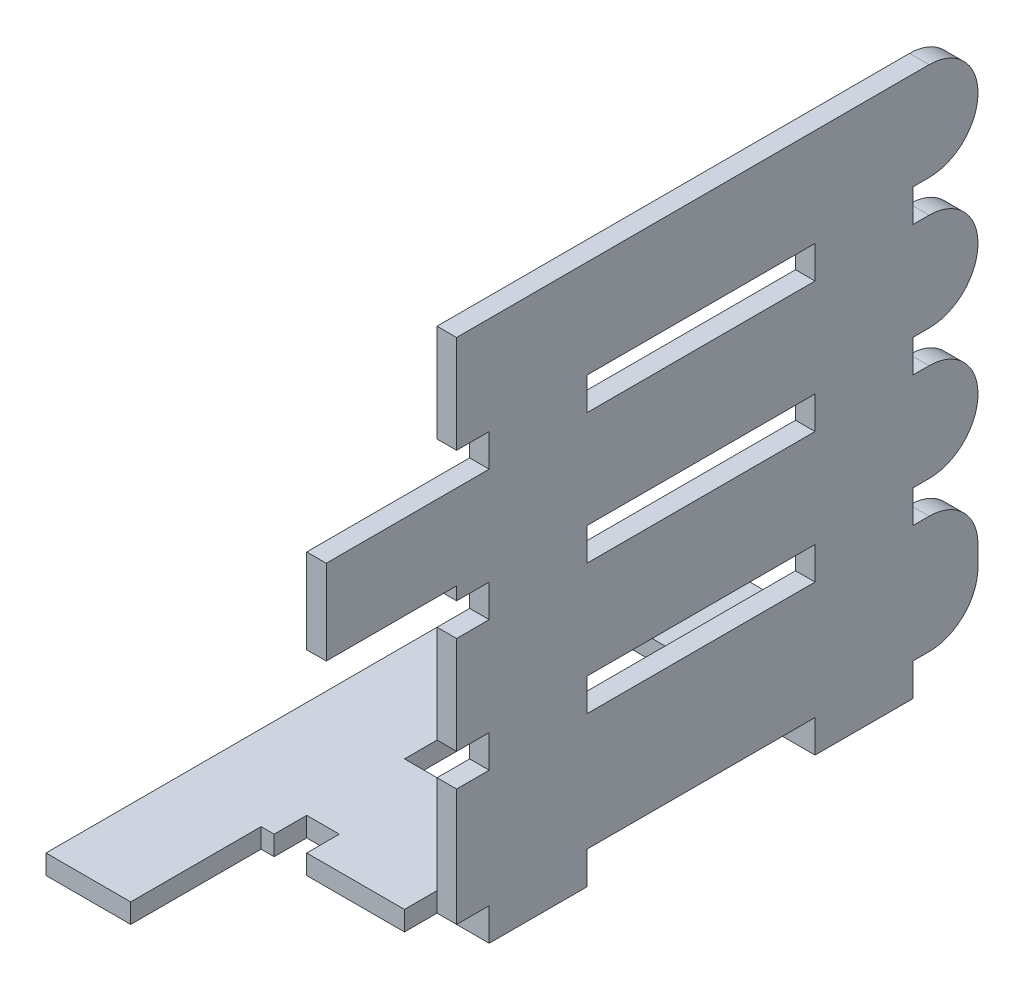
ISO-10303-21;
HEADER;
FILE_DESCRIPTION(('STEP AP214'),'2;1');
FILE_NAME('part.step','',(''),(''),'','','');
FILE_SCHEMA(('AUTOMOTIVE_DESIGN { 1 0 10303 214 1 1 1 1 }'));
ENDSEC;
DATA;
#1=APPLICATION_CONTEXT('core data for automotive mechanical design processes');
#2=APPLICATION_PROTOCOL_DEFINITION('international standard','automotive_design',2000,#1);
#3=PRODUCT_CONTEXT('',#1,'mechanical');
#4=PRODUCT('Part','Part','',(#3));
#5=PRODUCT_RELATED_PRODUCT_CATEGORY('part','',(#4));
#6=PRODUCT_DEFINITION_FORMATION('','',#4);
#7=PRODUCT_DEFINITION_CONTEXT('part definition',#1,'design');
#8=PRODUCT_DEFINITION('design','',#6,#7);
#9=PRODUCT_DEFINITION_SHAPE('','',#8);
#10=(LENGTH_UNIT() NAMED_UNIT(*) SI_UNIT(.MILLI.,.METRE.));
#11=(NAMED_UNIT(*) PLANE_ANGLE_UNIT() SI_UNIT($,.RADIAN.));
#12=(NAMED_UNIT(*) SI_UNIT($,.STERADIAN.) SOLID_ANGLE_UNIT());
#13=UNCERTAINTY_MEASURE_WITH_UNIT(LENGTH_MEASURE(1.E-05),#10,'distance_accuracy_value','');
#14=(GEOMETRIC_REPRESENTATION_CONTEXT(3) GLOBAL_UNCERTAINTY_ASSIGNED_CONTEXT((#13)) GLOBAL_UNIT_ASSIGNED_CONTEXT((#10,
#11,#12)) REPRESENTATION_CONTEXT('',''));
#15=CARTESIAN_POINT('',(0.,0.,0.));
#16=DIRECTION('',(0.,0.,1.));
#17=DIRECTION('',(1.,0.,0.));
#18=AXIS2_PLACEMENT_3D('',#15,#16,#17);
#19=CARTESIAN_POINT('',(40.,-3.,80.));
#20=DIRECTION('',(0.,0.,-1.));
#21=DIRECTION('',(-1.,0.,0.));
#22=AXIS2_PLACEMENT_3D('',#19,#20,#21);
#23=PLANE('',#22);
#24=DIRECTION('',(1.,0.,0.));
#25=VECTOR('',#24,1.);
#26=CARTESIAN_POINT('',(13.,0.,80.));
#27=LINE('',#26,#25);
#28=CARTESIAN_POINT('',(20.,0.,80.));
#29=VERTEX_POINT('',#28);
#30=CARTESIAN_POINT('',(35.,0.,80.));
#31=VERTEX_POINT('',#30);
#32=EDGE_CURVE('E958',#29,#31,#27,.T.);
#33=ORIENTED_EDGE('',*,*,#32,.F.);
#34=DIRECTION('',(0.,-1.,0.));
#35=VECTOR('',#34,1.);
#36=CARTESIAN_POINT('',(20.,0.,80.));
#37=LINE('',#36,#35);
#38=CARTESIAN_POINT('',(20.,-3.,80.));
#39=VERTEX_POINT('',#38);
#40=EDGE_CURVE('E603',#29,#39,#37,.T.);
#41=ORIENTED_EDGE('',*,*,#40,.T.);
#42=DIRECTION('',(1.,0.,0.));
#43=VECTOR('',#42,1.);
#44=CARTESIAN_POINT('',(40.,-3.,80.));
#45=LINE('',#44,#43);
#46=CARTESIAN_POINT('',(35.,-3.,80.));
#47=VERTEX_POINT('',#46);
#48=EDGE_CURVE('E977',#39,#47,#45,.T.);
#49=ORIENTED_EDGE('',*,*,#48,.T.);
#50=DIRECTION('',(0.,-1.,0.));
#51=VECTOR('',#50,1.);
#52=CARTESIAN_POINT('',(35.,0.,80.));
#53=LINE('',#52,#51);
#54=EDGE_CURVE('E653',#31,#47,#53,.T.);
#55=ORIENTED_EDGE('',*,*,#54,.F.);
#56=EDGE_LOOP('',(#33,#41,#49,#55));
#57=FACE_BOUND('',#56,.T.);
#58=ADVANCED_FACE('F33',(#57),#23,.F.);
#59=CARTESIAN_POINT('',(13.,-3.,80.));
#60=VERTEX_POINT('',#59);
#61=CARTESIAN_POINT('',(15.,-3.,80.));
#62=VERTEX_POINT('',#61);
#63=EDGE_CURVE('E990',#60,#62,#45,.T.);
#64=ORIENTED_EDGE('',*,*,#63,.T.);
#65=DIRECTION('',(0.,-1.,0.));
#66=VECTOR('',#65,1.);
#67=CARTESIAN_POINT('',(15.,0.,80.));
#68=LINE('',#67,#66);
#69=CARTESIAN_POINT('',(15.,0.,80.));
#70=VERTEX_POINT('',#69);
#71=EDGE_CURVE('E615',#70,#62,#68,.T.);
#72=ORIENTED_EDGE('',*,*,#71,.F.);
#73=CARTESIAN_POINT('',(13.,0.,80.));
#74=VERTEX_POINT('',#73);
#75=EDGE_CURVE('E959',#74,#70,#27,.T.);
#76=ORIENTED_EDGE('',*,*,#75,.F.);
#77=DIRECTION('',(0.,-1.,0.));
#78=VECTOR('',#77,1.);
#79=CARTESIAN_POINT('',(13.,0.,80.));
#80=LINE('',#79,#78);
#81=EDGE_CURVE('E962',#74,#60,#80,.T.);
#82=ORIENTED_EDGE('',*,*,#81,.T.);
#83=EDGE_LOOP('',(#64,#72,#76,#82));
#84=FACE_BOUND('',#83,.T.);
#85=ADVANCED_FACE('F1196',(#84),#23,.F.);
#86=DIRECTION('',(0.,1.,0.));
#87=VECTOR('',#86,1.);
#88=CARTESIAN_POINT('',(40.,-3.,80.));
#89=LINE('',#88,#87);
#90=CARTESIAN_POINT('',(40.,25.,80.));
#91=VERTEX_POINT('',#90);
#92=CARTESIAN_POINT('',(40.,40.,80.));
#93=VERTEX_POINT('',#92);
#94=EDGE_CURVE('E973',#91,#93,#89,.T.);
#95=ORIENTED_EDGE('',*,*,#94,.F.);
#96=DIRECTION('',(1.,0.,0.));
#97=VECTOR('',#96,1.);
#98=CARTESIAN_POINT('',(40.,25.,80.));
#99=LINE('',#98,#97);
#100=CARTESIAN_POINT('',(43.,25.,80.));
#101=VERTEX_POINT('',#100);
#102=EDGE_CURVE('E899',#91,#101,#99,.T.);
#103=ORIENTED_EDGE('',*,*,#102,.T.);
#104=DIRECTION('',(0.,1.,0.));
#105=VECTOR('',#104,1.);
#106=CARTESIAN_POINT('',(43.,-3.,80.));
#107=LINE('',#106,#105);
#108=CARTESIAN_POINT('',(43.,40.,80.));
#109=VERTEX_POINT('',#108);
#110=EDGE_CURVE('E981',#101,#109,#107,.T.);
#111=ORIENTED_EDGE('',*,*,#110,.T.);
#112=DIRECTION('',(1.,0.,0.));
#113=VECTOR('',#112,1.);
#114=CARTESIAN_POINT('',(40.,40.,80.));
#115=LINE('',#114,#113);
#116=EDGE_CURVE('E919',#93,#109,#115,.T.);
#117=ORIENTED_EDGE('',*,*,#116,.F.);
#118=EDGE_LOOP('',(#95,#103,#111,#117));
#119=FACE_BOUND('',#118,.T.);
#120=ADVANCED_FACE('F1231',(#119),#23,.F.);
#121=CARTESIAN_POINT('',(40.,45.,80.));
#122=VERTEX_POINT('',#121);
#123=CARTESIAN_POINT('',(40.,47.,80.));
#124=VERTEX_POINT('',#123);
#125=EDGE_CURVE('E974',#122,#124,#89,.T.);
#126=ORIENTED_EDGE('',*,*,#125,.F.);
#127=DIRECTION('',(1.,0.,0.));
#128=VECTOR('',#127,1.);
#129=CARTESIAN_POINT('',(40.,45.,80.));
#130=LINE('',#129,#128);
#131=CARTESIAN_POINT('',(43.,45.,80.));
#132=VERTEX_POINT('',#131);
#133=EDGE_CURVE('E926',#122,#132,#130,.T.);
#134=ORIENTED_EDGE('',*,*,#133,.T.);
#135=CARTESIAN_POINT('',(43.,47.,80.));
#136=VERTEX_POINT('',#135);
#137=EDGE_CURVE('E967',#132,#136,#107,.T.);
#138=ORIENTED_EDGE('',*,*,#137,.T.);
#139=DIRECTION('',(1.,0.,0.));
#140=VECTOR('',#139,1.);
#141=CARTESIAN_POINT('',(40.,47.,80.));
#142=LINE('',#141,#140);
#143=EDGE_CURVE('E987',#124,#136,#142,.T.);
#144=ORIENTED_EDGE('',*,*,#143,.F.);
#145=EDGE_LOOP('',(#126,#134,#138,#144));
#146=FACE_BOUND('',#145,.T.);
#147=ADVANCED_FACE('F1237',(#146),#23,.F.);
#148=CARTESIAN_POINT('',(43.,80.,100.));
#149=DIRECTION('',(0.,0.,-1.));
#150=DIRECTION('',(-1.,0.,0.));
#151=AXIS2_PLACEMENT_3D('',#148,#149,#150);
#152=PLANE('',#151);
#153=DIRECTION('',(0.,1.,0.));
#154=VECTOR('',#153,1.);
#155=CARTESIAN_POINT('',(40.,0.,100.));
#156=LINE('',#155,#154);
#157=CARTESIAN_POINT('',(40.,47.,100.));
#158=VERTEX_POINT('',#157);
#159=CARTESIAN_POINT('',(40.,60.,100.));
#160=VERTEX_POINT('',#159);
#161=EDGE_CURVE('E1009',#158,#160,#156,.T.);
#162=ORIENTED_EDGE('',*,*,#161,.F.);
#163=DIRECTION('',(1.,0.,0.));
#164=VECTOR('',#163,1.);
#165=CARTESIAN_POINT('',(40.,47.,100.));
#166=LINE('',#165,#164);
#167=CARTESIAN_POINT('',(43.,47.,100.));
#168=VERTEX_POINT('',#167);
#169=EDGE_CURVE('E983',#158,#168,#166,.T.);
#170=ORIENTED_EDGE('',*,*,#169,.T.);
#171=DIRECTION('',(0.,1.,0.));
#172=VECTOR('',#171,1.);
#173=CARTESIAN_POINT('',(43.,0.,100.));
#174=LINE('',#173,#172);
#175=CARTESIAN_POINT('',(43.,60.,100.));
#176=VERTEX_POINT('',#175);
#177=EDGE_CURVE('E1007',#168,#176,#174,.T.);
#178=ORIENTED_EDGE('',*,*,#177,.T.);
#179=DIRECTION('',(1.,0.,0.));
#180=VECTOR('',#179,1.);
#181=CARTESIAN_POINT('',(40.,60.,100.));
#182=LINE('',#181,#180);
#183=EDGE_CURVE('E998',#160,#176,#182,.T.);
#184=ORIENTED_EDGE('',*,*,#183,.F.);
#185=EDGE_LOOP('',(#162,#170,#178,#184));
#186=FACE_BOUND('',#185,.T.);
#187=ADVANCED_FACE('F1248',(#186),#152,.F.);
#188=CARTESIAN_POINT('',(43.,0.,100.));
#189=DIRECTION('',(-1.,0.,0.));
#190=DIRECTION('',(0.,0.,1.));
#191=AXIS2_PLACEMENT_3D('',#188,#189,#190);
#192=PLANE('',#191);
#193=DIRECTION('',(0.,0.,-1.));
#194=VECTOR('',#193,1.);
#195=CARTESIAN_POINT('',(43.,20.,60.));
#196=LINE('',#195,#194);
#197=CARTESIAN_POINT('',(43.,20.,60.));
#198=VERTEX_POINT('',#197);
#199=CARTESIAN_POINT('',(43.,20.,25.));
#200=VERTEX_POINT('',#199);
#201=EDGE_CURVE('E759',#198,#200,#196,.T.);
#202=ORIENTED_EDGE('',*,*,#201,.F.);
#203=DIRECTION('',(0.,-1.,0.));
#204=VECTOR('',#203,1.);
#205=CARTESIAN_POINT('',(43.,25.,60.));
#206=LINE('',#205,#204);
#207=CARTESIAN_POINT('',(43.,25.,60.));
#208=VERTEX_POINT('',#207);
#209=EDGE_CURVE('E742',#208,#198,#206,.T.);
#210=ORIENTED_EDGE('',*,*,#209,.F.);
#211=DIRECTION('',(0.,0.,1.));
#212=VECTOR('',#211,1.);
#213=CARTESIAN_POINT('',(43.,25.,60.));
#214=LINE('',#213,#212);
#215=CARTESIAN_POINT('',(43.,25.,25.));
#216=VERTEX_POINT('',#215);
#217=EDGE_CURVE('E748',#216,#208,#214,.T.);
#218=ORIENTED_EDGE('',*,*,#217,.F.);
#219=DIRECTION('',(0.,1.,0.));
#220=VECTOR('',#219,1.);
#221=CARTESIAN_POINT('',(43.,25.,25.));
#222=LINE('',#221,#220);
#223=EDGE_CURVE('E762',#200,#216,#222,.T.);
#224=ORIENTED_EDGE('',*,*,#223,.F.);
#225=EDGE_LOOP('',(#202,#210,#218,#224));
#226=FACE_BOUND('',#225,.T.);
#227=DIRECTION('',(0.,0.,-1.));
#228=VECTOR('',#227,1.);
#229=CARTESIAN_POINT('',(43.,40.,60.));
#230=LINE('',#229,#228);
#231=CARTESIAN_POINT('',(43.,40.,60.));
#232=VERTEX_POINT('',#231);
#233=CARTESIAN_POINT('',(43.,40.,25.));
#234=VERTEX_POINT('',#233);
#235=EDGE_CURVE('E812',#232,#234,#230,.T.);
#236=ORIENTED_EDGE('',*,*,#235,.F.);
#237=DIRECTION('',(0.,-1.,0.));
#238=VECTOR('',#237,1.);
#239=CARTESIAN_POINT('',(43.,40.,60.));
#240=LINE('',#239,#238);
#241=CARTESIAN_POINT('',(43.,45.,60.));
#242=VERTEX_POINT('',#241);
#243=EDGE_CURVE('E795',#242,#232,#240,.T.);
#244=ORIENTED_EDGE('',*,*,#243,.F.);
#245=DIRECTION('',(0.,0.,1.));
#246=VECTOR('',#245,1.);
#247=CARTESIAN_POINT('',(43.,45.,60.));
#248=LINE('',#247,#246);
#249=CARTESIAN_POINT('',(43.,45.,25.));
#250=VERTEX_POINT('',#249);
#251=EDGE_CURVE('E801',#250,#242,#248,.T.);
#252=ORIENTED_EDGE('',*,*,#251,.F.);
#253=DIRECTION('',(0.,1.,0.));
#254=VECTOR('',#253,1.);
#255=CARTESIAN_POINT('',(43.,40.,25.));
#256=LINE('',#255,#254);
#257=EDGE_CURVE('E815',#234,#250,#256,.T.);
#258=ORIENTED_EDGE('',*,*,#257,.F.);
#259=EDGE_LOOP('',(#236,#244,#252,#258));
#260=FACE_BOUND('',#259,.T.);
#261=DIRECTION('',(0.,0.,-1.));
#262=VECTOR('',#261,1.);
#263=CARTESIAN_POINT('',(43.,60.,60.));
#264=LINE('',#263,#262);
#265=CARTESIAN_POINT('',(43.,60.,60.));
#266=VERTEX_POINT('',#265);
#267=CARTESIAN_POINT('',(43.,60.,25.));
#268=VERTEX_POINT('',#267);
#269=EDGE_CURVE('E865',#266,#268,#264,.T.);
#270=ORIENTED_EDGE('',*,*,#269,.F.);
#271=DIRECTION('',(0.,-1.,0.));
#272=VECTOR('',#271,1.);
#273=CARTESIAN_POINT('',(43.,65.,60.));
#274=LINE('',#273,#272);
#275=CARTESIAN_POINT('',(43.,65.,60.));
#276=VERTEX_POINT('',#275);
#277=EDGE_CURVE('E848',#276,#266,#274,.T.);
#278=ORIENTED_EDGE('',*,*,#277,.F.);
#279=DIRECTION('',(0.,0.,1.));
#280=VECTOR('',#279,1.);
#281=CARTESIAN_POINT('',(43.,65.,60.));
#282=LINE('',#281,#280);
#283=CARTESIAN_POINT('',(43.,65.,25.));
#284=VERTEX_POINT('',#283);
#285=EDGE_CURVE('E854',#284,#276,#282,.T.);
#286=ORIENTED_EDGE('',*,*,#285,.F.);
#287=DIRECTION('',(0.,1.,0.));
#288=VECTOR('',#287,1.);
#289=CARTESIAN_POINT('',(43.,65.,25.));
#290=LINE('',#289,#288);
#291=EDGE_CURVE('E868',#268,#284,#290,.T.);
#292=ORIENTED_EDGE('',*,*,#291,.F.);
#293=EDGE_LOOP('',(#270,#278,#286,#292));
#294=FACE_BOUND('',#293,.T.);
#295=DIRECTION('',(0.,0.,1.));
#296=VECTOR('',#295,1.);
#297=CARTESIAN_POINT('',(43.,2.,10.));
#298=LINE('',#297,#296);
#299=CARTESIAN_POINT('',(43.,2.,7.5));
#300=VERTEX_POINT('',#299);
#301=CARTESIAN_POINT('',(43.,2.,10.));
#302=VERTEX_POINT('',#301);
#303=EDGE_CURVE('E666',#300,#302,#298,.T.);
#304=ORIENTED_EDGE('',*,*,#303,.F.);
#305=CARTESIAN_POINT('',(43.,9.5,7.5));
#306=DIRECTION('',(-1.,0.,0.));
#307=DIRECTION('',(0.,0.,1.));
#308=AXIS2_PLACEMENT_3D('',#305,#306,#307);
#309=CIRCLE('',#308,7.5);
#310=CARTESIAN_POINT('',(43.,9.5,0.));
#311=VERTEX_POINT('',#310);
#312=EDGE_CURVE('E1061',#300,#311,#309,.F.);
#313=ORIENTED_EDGE('',*,*,#312,.T.);
#314=DIRECTION('',(0.,1.,0.));
#315=VECTOR('',#314,1.);
#316=CARTESIAN_POINT('',(43.,0.,0.));
#317=LINE('',#316,#315);
#318=CARTESIAN_POINT('',(43.,12.5,0.));
#319=VERTEX_POINT('',#318);
#320=EDGE_CURVE('E1004',#311,#319,#317,.T.);
#321=ORIENTED_EDGE('',*,*,#320,.T.);
#322=CARTESIAN_POINT('',(43.,12.5,7.5));
#323=DIRECTION('',(-1.,0.,0.));
#324=DIRECTION('',(0.,0.,1.));
#325=AXIS2_PLACEMENT_3D('',#322,#323,#324);
#326=CIRCLE('',#325,7.5);
#327=CARTESIAN_POINT('',(43.,20.,7.5));
#328=VERTEX_POINT('',#327);
#329=EDGE_CURVE('E1059',#319,#328,#326,.F.);
#330=ORIENTED_EDGE('',*,*,#329,.T.);
#331=DIRECTION('',(0.,0.,-1.));
#332=VECTOR('',#331,1.);
#333=CARTESIAN_POINT('',(43.,20.,10.));
#334=LINE('',#333,#332);
#335=CARTESIAN_POINT('',(43.,20.,10.));
#336=VERTEX_POINT('',#335);
#337=EDGE_CURVE('E735',#336,#328,#334,.T.);
#338=ORIENTED_EDGE('',*,*,#337,.F.);
#339=DIRECTION('',(0.,-1.,0.));
#340=VECTOR('',#339,1.);
#341=CARTESIAN_POINT('',(43.,25.,10.));
#342=LINE('',#341,#340);
#343=CARTESIAN_POINT('',(43.,25.,10.));
#344=VERTEX_POINT('',#343);
#345=EDGE_CURVE('E719',#344,#336,#342,.T.);
#346=ORIENTED_EDGE('',*,*,#345,.F.);
#347=DIRECTION('',(0.,0.,1.));
#348=VECTOR('',#347,1.);
#349=CARTESIAN_POINT('',(43.,25.,10.));
#350=LINE('',#349,#348);
#351=CARTESIAN_POINT('',(43.,25.,7.5));
#352=VERTEX_POINT('',#351);
#353=EDGE_CURVE('E727',#352,#344,#350,.T.);
#354=ORIENTED_EDGE('',*,*,#353,.F.);
#355=CARTESIAN_POINT('',(43.,32.5,7.5));
#356=DIRECTION('',(-1.,0.,0.));
#357=DIRECTION('',(0.,0.,1.));
#358=AXIS2_PLACEMENT_3D('',#355,#356,#357);
#359=CIRCLE('',#358,7.5);
#360=CARTESIAN_POINT('',(43.,32.5,0.));
#361=VERTEX_POINT('',#360);
#362=EDGE_CURVE('E1057',#352,#361,#359,.F.);
#363=ORIENTED_EDGE('',*,*,#362,.T.);
#364=CARTESIAN_POINT('',(43.,32.5,7.5));
#365=DIRECTION('',(-1.,0.,0.));
#366=DIRECTION('',(0.,0.,1.));
#367=AXIS2_PLACEMENT_3D('',#364,#365,#366);
#368=CIRCLE('',#367,7.5);
#369=CARTESIAN_POINT('',(43.,40.,7.5));
#370=VERTEX_POINT('',#369);
#371=EDGE_CURVE('E1055',#361,#370,#368,.F.);
#372=ORIENTED_EDGE('',*,*,#371,.T.);
#373=DIRECTION('',(0.,0.,-1.));
#374=VECTOR('',#373,1.);
#375=CARTESIAN_POINT('',(43.,40.,10.));
#376=LINE('',#375,#374);
#377=CARTESIAN_POINT('',(43.,40.,10.));
#378=VERTEX_POINT('',#377);
#379=EDGE_CURVE('E788',#378,#370,#376,.T.);
#380=ORIENTED_EDGE('',*,*,#379,.F.);
#381=DIRECTION('',(0.,-1.,0.));
#382=VECTOR('',#381,1.);
#383=CARTESIAN_POINT('',(43.,45.,10.));
#384=LINE('',#383,#382);
#385=CARTESIAN_POINT('',(43.,45.,10.));
#386=VERTEX_POINT('',#385);
#387=EDGE_CURVE('E769',#386,#378,#384,.T.);
#388=ORIENTED_EDGE('',*,*,#387,.F.);
#389=DIRECTION('',(0.,0.,1.));
#390=VECTOR('',#389,1.);
#391=CARTESIAN_POINT('',(43.,45.,10.));
#392=LINE('',#391,#390);
#393=CARTESIAN_POINT('',(43.,45.,7.5));
#394=VERTEX_POINT('',#393);
#395=EDGE_CURVE('E780',#394,#386,#392,.T.);
#396=ORIENTED_EDGE('',*,*,#395,.F.);
#397=CARTESIAN_POINT('',(43.,52.5,7.5));
#398=DIRECTION('',(-1.,0.,0.));
#399=DIRECTION('',(0.,0.,1.));
#400=AXIS2_PLACEMENT_3D('',#397,#398,#399);
#401=CIRCLE('',#400,7.5);
#402=CARTESIAN_POINT('',(43.,52.5,0.));
#403=VERTEX_POINT('',#402);
#404=EDGE_CURVE('E1053',#394,#403,#401,.F.);
#405=ORIENTED_EDGE('',*,*,#404,.T.);
#406=CARTESIAN_POINT('',(43.,52.5,7.5));
#407=DIRECTION('',(-1.,0.,0.));
#408=DIRECTION('',(0.,0.,1.));
#409=AXIS2_PLACEMENT_3D('',#406,#407,#408);
#410=CIRCLE('',#409,7.5);
#411=CARTESIAN_POINT('',(43.,60.,7.5));
#412=VERTEX_POINT('',#411);
#413=EDGE_CURVE('E1051',#403,#412,#410,.F.);
#414=ORIENTED_EDGE('',*,*,#413,.T.);
#415=DIRECTION('',(0.,0.,-1.));
#416=VECTOR('',#415,1.);
#417=CARTESIAN_POINT('',(43.,60.,10.));
#418=LINE('',#417,#416);
#419=CARTESIAN_POINT('',(43.,60.,10.));
#420=VERTEX_POINT('',#419);
#421=EDGE_CURVE('E841',#420,#412,#418,.T.);
#422=ORIENTED_EDGE('',*,*,#421,.F.);
#423=DIRECTION('',(0.,-1.,0.));
#424=VECTOR('',#423,1.);
#425=CARTESIAN_POINT('',(43.,65.,10.));
#426=LINE('',#425,#424);
#427=CARTESIAN_POINT('',(43.,65.,10.));
#428=VERTEX_POINT('',#427);
#429=EDGE_CURVE('E822',#428,#420,#426,.T.);
#430=ORIENTED_EDGE('',*,*,#429,.F.);
#431=DIRECTION('',(0.,0.,1.));
#432=VECTOR('',#431,1.);
#433=CARTESIAN_POINT('',(43.,65.,10.));
#434=LINE('',#433,#432);
#435=CARTESIAN_POINT('',(43.,65.,7.5));
#436=VERTEX_POINT('',#435);
#437=EDGE_CURVE('E833',#436,#428,#434,.T.);
#438=ORIENTED_EDGE('',*,*,#437,.F.);
#439=CARTESIAN_POINT('',(43.,72.5,7.5));
#440=DIRECTION('',(-1.,0.,0.));
#441=DIRECTION('',(0.,0.,1.));
#442=AXIS2_PLACEMENT_3D('',#439,#440,#441);
#443=CIRCLE('',#442,7.5);
#444=CARTESIAN_POINT('',(43.,72.5,0.));
#445=VERTEX_POINT('',#444);
#446=EDGE_CURVE('E1049',#436,#445,#443,.F.);
#447=ORIENTED_EDGE('',*,*,#446,.T.);
#448=CARTESIAN_POINT('',(43.,72.5,7.5));
#449=DIRECTION('',(-1.,0.,0.));
#450=DIRECTION('',(0.,0.,1.));
#451=AXIS2_PLACEMENT_3D('',#448,#449,#450);
#452=CIRCLE('',#451,7.5);
#453=CARTESIAN_POINT('',(43.,80.,7.50000000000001));
#454=VERTEX_POINT('',#453);
#455=EDGE_CURVE('E1047',#445,#454,#452,.F.);
#456=ORIENTED_EDGE('',*,*,#455,.T.);
#457=DIRECTION('',(0.,0.,-1.));
#458=VECTOR('',#457,1.);
#459=CARTESIAN_POINT('',(43.,80.,100.));
#460=LINE('',#459,#458);
#461=CARTESIAN_POINT('',(43.,80.,80.));
#462=VERTEX_POINT('',#461);
#463=EDGE_CURVE('E1041',#462,#454,#460,.T.);
#464=ORIENTED_EDGE('',*,*,#463,.F.);
#465=DIRECTION('',(0.,1.,0.));
#466=VECTOR('',#465,1.);
#467=CARTESIAN_POINT('',(43.,80.,80.));
#468=LINE('',#467,#466);
#469=CARTESIAN_POINT('',(43.,65.,80.));
#470=VERTEX_POINT('',#469);
#471=EDGE_CURVE('E996',#470,#462,#468,.T.);
#472=ORIENTED_EDGE('',*,*,#471,.F.);
#473=DIRECTION('',(0.,0.,1.));
#474=VECTOR('',#473,1.);
#475=CARTESIAN_POINT('',(43.,65.,80.));
#476=LINE('',#475,#474);
#477=CARTESIAN_POINT('',(43.,65.,75.));
#478=VERTEX_POINT('',#477);
#479=EDGE_CURVE('E940',#478,#470,#476,.T.);
#480=ORIENTED_EDGE('',*,*,#479,.F.);
#481=DIRECTION('',(0.,1.,0.));
#482=VECTOR('',#481,1.);
#483=CARTESIAN_POINT('',(43.,65.,75.));
#484=LINE('',#483,#482);
#485=CARTESIAN_POINT('',(43.,60.,75.));
#486=VERTEX_POINT('',#485);
#487=EDGE_CURVE('E929',#486,#478,#484,.T.);
#488=ORIENTED_EDGE('',*,*,#487,.F.);
#489=DIRECTION('',(0.,0.,-1.));
#490=VECTOR('',#489,1.);
#491=CARTESIAN_POINT('',(43.,60.,100.));
#492=LINE('',#491,#490);
#493=EDGE_CURVE('E986',#176,#486,#492,.T.);
#494=ORIENTED_EDGE('',*,*,#493,.F.);
#495=ORIENTED_EDGE('',*,*,#177,.F.);
#496=DIRECTION('',(0.,0.,1.));
#497=VECTOR('',#496,1.);
#498=CARTESIAN_POINT('',(43.,47.,100.));
#499=LINE('',#498,#497);
#500=EDGE_CURVE('E980',#136,#168,#499,.T.);
#501=ORIENTED_EDGE('',*,*,#500,.F.);
#502=ORIENTED_EDGE('',*,*,#137,.F.);
#503=DIRECTION('',(0.,0.,1.));
#504=VECTOR('',#503,1.);
#505=CARTESIAN_POINT('',(43.,45.,80.));
#506=LINE('',#505,#504);
#507=CARTESIAN_POINT('',(43.,45.,75.));
#508=VERTEX_POINT('',#507);
#509=EDGE_CURVE('E913',#508,#132,#506,.T.);
#510=ORIENTED_EDGE('',*,*,#509,.F.);
#511=DIRECTION('',(0.,1.,0.));
#512=VECTOR('',#511,1.);
#513=CARTESIAN_POINT('',(43.,45.,75.));
#514=LINE('',#513,#512);
#515=CARTESIAN_POINT('',(43.,40.,75.));
#516=VERTEX_POINT('',#515);
#517=EDGE_CURVE('E922',#516,#508,#514,.T.);
#518=ORIENTED_EDGE('',*,*,#517,.F.);
#519=DIRECTION('',(0.,0.,-1.));
#520=VECTOR('',#519,1.);
#521=CARTESIAN_POINT('',(43.,40.,80.));
#522=LINE('',#521,#520);
#523=EDGE_CURVE('E902',#109,#516,#522,.T.);
#524=ORIENTED_EDGE('',*,*,#523,.F.);
#525=ORIENTED_EDGE('',*,*,#110,.F.);
#526=DIRECTION('',(0.,0.,1.));
#527=VECTOR('',#526,1.);
#528=CARTESIAN_POINT('',(43.,25.,80.));
#529=LINE('',#528,#527);
#530=CARTESIAN_POINT('',(43.,25.,75.));
#531=VERTEX_POINT('',#530);
#532=EDGE_CURVE('E886',#531,#101,#529,.T.);
#533=ORIENTED_EDGE('',*,*,#532,.F.);
#534=DIRECTION('',(0.,1.,0.));
#535=VECTOR('',#534,1.);
#536=CARTESIAN_POINT('',(43.,25.,75.));
#537=LINE('',#536,#535);
#538=CARTESIAN_POINT('',(43.,20.,75.));
#539=VERTEX_POINT('',#538);
#540=EDGE_CURVE('E895',#539,#531,#537,.T.);
#541=ORIENTED_EDGE('',*,*,#540,.F.);
#542=DIRECTION('',(0.,0.,-1.));
#543=VECTOR('',#542,1.);
#544=CARTESIAN_POINT('',(43.,20.,80.));
#545=LINE('',#544,#543);
#546=CARTESIAN_POINT('',(43.,20.,80.));
#547=VERTEX_POINT('',#546);
#548=EDGE_CURVE('E875',#547,#539,#545,.T.);
#549=ORIENTED_EDGE('',*,*,#548,.F.);
#550=CARTESIAN_POINT('',(43.,2.,80.));
#551=VERTEX_POINT('',#550);
#552=EDGE_CURVE('E978',#551,#547,#107,.T.);
#553=ORIENTED_EDGE('',*,*,#552,.F.);
#554=DIRECTION('',(0.,0.,1.));
#555=VECTOR('',#554,1.);
#556=CARTESIAN_POINT('',(43.,2.,80.));
#557=LINE('',#556,#555);
#558=CARTESIAN_POINT('',(43.,2.,75.));
#559=VERTEX_POINT('',#558);
#560=EDGE_CURVE('E709',#559,#551,#557,.T.);
#561=ORIENTED_EDGE('',*,*,#560,.F.);
#562=DIRECTION('',(0.,1.,0.));
#563=VECTOR('',#562,1.);
#564=CARTESIAN_POINT('',(43.,2.,75.));
#565=LINE('',#564,#563);
#566=CARTESIAN_POINT('',(43.,-3.,75.));
#567=VERTEX_POINT('',#566);
#568=EDGE_CURVE('E698',#567,#559,#565,.T.);
#569=ORIENTED_EDGE('',*,*,#568,.F.);
#570=DIRECTION('',(0.,0.,-1.));
#571=VECTOR('',#570,1.);
#572=CARTESIAN_POINT('',(43.,-3.,100.));
#573=LINE('',#572,#571);
#574=CARTESIAN_POINT('',(43.,-3.,60.));
#575=VERTEX_POINT('',#574);
#576=EDGE_CURVE('E1026',#567,#575,#573,.T.);
#577=ORIENTED_EDGE('',*,*,#576,.T.);
#578=DIRECTION('',(0.,-1.,0.));
#579=VECTOR('',#578,1.);
#580=CARTESIAN_POINT('',(43.,2.,60.));
#581=LINE('',#580,#579);
#582=CARTESIAN_POINT('',(43.,2.,60.));
#583=VERTEX_POINT('',#582);
#584=EDGE_CURVE('E676',#583,#575,#581,.T.);
#585=ORIENTED_EDGE('',*,*,#584,.F.);
#586=DIRECTION('',(0.,0.,1.));
#587=VECTOR('',#586,1.);
#588=CARTESIAN_POINT('',(43.,2.,60.));
#589=LINE('',#588,#587);
#590=CARTESIAN_POINT('',(43.,2.,25.));
#591=VERTEX_POINT('',#590);
#592=EDGE_CURVE('E683',#591,#583,#589,.T.);
#593=ORIENTED_EDGE('',*,*,#592,.F.);
#594=DIRECTION('',(0.,1.,0.));
#595=VECTOR('',#594,1.);
#596=CARTESIAN_POINT('',(43.,2.,25.));
#597=LINE('',#596,#595);
#598=CARTESIAN_POINT('',(43.,-3.,25.));
#599=VERTEX_POINT('',#598);
#600=EDGE_CURVE('E691',#599,#591,#597,.T.);
#601=ORIENTED_EDGE('',*,*,#600,.F.);
#602=CARTESIAN_POINT('',(43.,-3.,10.));
#603=VERTEX_POINT('',#602);
#604=EDGE_CURVE('E1021',#599,#603,#573,.T.);
#605=ORIENTED_EDGE('',*,*,#604,.T.);
#606=DIRECTION('',(0.,-1.,0.));
#607=VECTOR('',#606,1.);
#608=CARTESIAN_POINT('',(43.,2.,10.));
#609=LINE('',#608,#607);
#610=EDGE_CURVE('E669',#302,#603,#609,.T.);
#611=ORIENTED_EDGE('',*,*,#610,.F.);
#612=EDGE_LOOP('',(#304,#313,#321,#330,#338,#346,#354,#363,#372,#380,#388,#396,#405,#414,#422,
#430,#438,#447,#456,#464,#472,#480,#488,#494,#495,#501,#502,#510,#518,#524,#525,#533,#541,#549,
#553,#561,#569,#577,#585,#593,#601,#605,#611));
#613=FACE_BOUND('',#612,.T.);
#614=ADVANCED_FACE('F1152',(#226,#260,#294,#613),#192,.F.);
#615=CARTESIAN_POINT('',(40.,80.,100.));
#616=DIRECTION('',(0.,1.,0.));
#617=DIRECTION('',(0.,0.,1.));
#618=AXIS2_PLACEMENT_3D('',#615,#616,#617);
#619=PLANE('',#618);
#620=ORIENTED_EDGE('',*,*,#463,.T.);
#621=DIRECTION('',(1.,0.,0.));
#622=VECTOR('',#621,1.);
#623=CARTESIAN_POINT('',(40.,80.,7.50000000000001));
#624=LINE('',#623,#622);
#625=CARTESIAN_POINT('',(40.,80.,7.50000000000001));
#626=VERTEX_POINT('',#625);
#627=EDGE_CURVE('E1099',#454,#626,#624,.F.);
#628=ORIENTED_EDGE('',*,*,#627,.T.);
#629=DIRECTION('',(0.,0.,-1.));
#630=VECTOR('',#629,1.);
#631=CARTESIAN_POINT('',(40.,80.,100.));
#632=LINE('',#631,#630);
#633=CARTESIAN_POINT('',(40.,80.,80.));
#634=VERTEX_POINT('',#633);
#635=EDGE_CURVE('E1038',#634,#626,#632,.T.);
#636=ORIENTED_EDGE('',*,*,#635,.F.);
#637=DIRECTION('',(1.,0.,0.));
#638=VECTOR('',#637,1.);
#639=CARTESIAN_POINT('',(40.,80.,80.));
#640=LINE('',#639,#638);
#641=EDGE_CURVE('E1001',#634,#462,#640,.T.);
#642=ORIENTED_EDGE('',*,*,#641,.T.);
#643=EDGE_LOOP('',(#620,#628,#636,#642));
#644=FACE_BOUND('',#643,.T.);
#645=ADVANCED_FACE('F1300',(#644),#619,.T.);
#646=CARTESIAN_POINT('',(40.,0.,100.));
#647=DIRECTION('',(-1.,0.,0.));
#648=DIRECTION('',(0.,0.,1.));
#649=AXIS2_PLACEMENT_3D('',#646,#647,#648);
#650=PLANE('',#649);
#651=DIRECTION('',(0.,1.,0.));
#652=VECTOR('',#651,1.);
#653=CARTESIAN_POINT('',(40.,0.,0.));
#654=LINE('',#653,#652);
#655=CARTESIAN_POINT('',(40.,9.5,0.));
#656=VERTEX_POINT('',#655);
#657=CARTESIAN_POINT('',(40.,12.5,0.));
#658=VERTEX_POINT('',#657);
#659=EDGE_CURVE('E1010',#656,#658,#654,.T.);
#660=ORIENTED_EDGE('',*,*,#659,.F.);
#661=CARTESIAN_POINT('',(40.,9.5,7.5));
#662=DIRECTION('',(-1.,0.,0.));
#663=DIRECTION('',(0.,0.,1.));
#664=AXIS2_PLACEMENT_3D('',#661,#662,#663);
#665=CIRCLE('',#664,7.5);
#666=CARTESIAN_POINT('',(40.,2.,7.5));
#667=VERTEX_POINT('',#666);
#668=EDGE_CURVE('E1082',#656,#667,#665,.T.);
#669=ORIENTED_EDGE('',*,*,#668,.T.);
#670=DIRECTION('',(0.,0.,1.));
#671=VECTOR('',#670,1.);
#672=CARTESIAN_POINT('',(40.,2.,10.));
#673=LINE('',#672,#671);
#674=CARTESIAN_POINT('',(40.,2.,10.));
#675=VERTEX_POINT('',#674);
#676=EDGE_CURVE('E665',#667,#675,#673,.T.);
#677=ORIENTED_EDGE('',*,*,#676,.T.);
#678=DIRECTION('',(0.,-1.,0.));
#679=VECTOR('',#678,1.);
#680=CARTESIAN_POINT('',(40.,2.,10.));
#681=LINE('',#680,#679);
#682=CARTESIAN_POINT('',(40.,0.,10.));
#683=VERTEX_POINT('',#682);
#684=EDGE_CURVE('E662',#675,#683,#681,.T.);
#685=ORIENTED_EDGE('',*,*,#684,.T.);
#686=DIRECTION('',(0.,0.,-1.));
#687=VECTOR('',#686,1.);
#688=CARTESIAN_POINT('',(40.,0.,100.));
#689=LINE('',#688,#687);
#690=CARTESIAN_POINT('',(40.,0.,25.));
#691=VERTEX_POINT('',#690);
#692=EDGE_CURVE('E1034',#691,#683,#689,.T.);
#693=ORIENTED_EDGE('',*,*,#692,.F.);
#694=DIRECTION('',(0.,1.,0.));
#695=VECTOR('',#694,1.);
#696=CARTESIAN_POINT('',(40.,2.,25.));
#697=LINE('',#696,#695);
#698=CARTESIAN_POINT('',(40.,2.,25.));
#699=VERTEX_POINT('',#698);
#700=EDGE_CURVE('E682',#691,#699,#697,.T.);
#701=ORIENTED_EDGE('',*,*,#700,.T.);
#702=DIRECTION('',(0.,0.,1.));
#703=VECTOR('',#702,1.);
#704=CARTESIAN_POINT('',(40.,2.,60.));
#705=LINE('',#704,#703);
#706=CARTESIAN_POINT('',(40.,2.,60.));
#707=VERTEX_POINT('',#706);
#708=EDGE_CURVE('E686',#699,#707,#705,.T.);
#709=ORIENTED_EDGE('',*,*,#708,.T.);
#710=DIRECTION('',(0.,-1.,0.));
#711=VECTOR('',#710,1.);
#712=CARTESIAN_POINT('',(40.,2.,60.));
#713=LINE('',#712,#711);
#714=CARTESIAN_POINT('',(40.,0.,60.));
#715=VERTEX_POINT('',#714);
#716=EDGE_CURVE('E679',#707,#715,#713,.T.);
#717=ORIENTED_EDGE('',*,*,#716,.T.);
#718=CARTESIAN_POINT('',(40.,0.,75.));
#719=VERTEX_POINT('',#718);
#720=EDGE_CURVE('E1037',#719,#715,#689,.T.);
#721=ORIENTED_EDGE('',*,*,#720,.F.);
#722=DIRECTION('',(0.,1.,0.));
#723=VECTOR('',#722,1.);
#724=CARTESIAN_POINT('',(40.,2.,75.));
#725=LINE('',#724,#723);
#726=CARTESIAN_POINT('',(40.,2.,75.));
#727=VERTEX_POINT('',#726);
#728=EDGE_CURVE('E705',#719,#727,#725,.T.);
#729=ORIENTED_EDGE('',*,*,#728,.T.);
#730=DIRECTION('',(0.,0.,1.));
#731=VECTOR('',#730,1.);
#732=CARTESIAN_POINT('',(40.,2.,80.));
#733=LINE('',#732,#731);
#734=CARTESIAN_POINT('',(40.,2.,80.));
#735=VERTEX_POINT('',#734);
#736=EDGE_CURVE('E708',#727,#735,#733,.T.);
#737=ORIENTED_EDGE('',*,*,#736,.T.);
#738=CARTESIAN_POINT('',(40.,20.,80.));
#739=VERTEX_POINT('',#738);
#740=EDGE_CURVE('E970',#735,#739,#89,.T.);
#741=ORIENTED_EDGE('',*,*,#740,.T.);
#742=DIRECTION('',(0.,0.,-1.));
#743=VECTOR('',#742,1.);
#744=CARTESIAN_POINT('',(40.,20.,80.));
#745=LINE('',#744,#743);
#746=CARTESIAN_POINT('',(40.,20.,75.));
#747=VERTEX_POINT('',#746);
#748=EDGE_CURVE('E882',#739,#747,#745,.T.);
#749=ORIENTED_EDGE('',*,*,#748,.T.);
#750=DIRECTION('',(0.,1.,0.));
#751=VECTOR('',#750,1.);
#752=CARTESIAN_POINT('',(40.,25.,75.));
#753=LINE('',#752,#751);
#754=CARTESIAN_POINT('',(40.,25.,75.));
#755=VERTEX_POINT('',#754);
#756=EDGE_CURVE('E885',#747,#755,#753,.T.);
#757=ORIENTED_EDGE('',*,*,#756,.T.);
#758=DIRECTION('',(0.,0.,1.));
#759=VECTOR('',#758,1.);
#760=CARTESIAN_POINT('',(40.,25.,80.));
#761=LINE('',#760,#759);
#762=EDGE_CURVE('E889',#755,#91,#761,.T.);
#763=ORIENTED_EDGE('',*,*,#762,.T.);
#764=ORIENTED_EDGE('',*,*,#94,.T.);
#765=DIRECTION('',(0.,0.,-1.));
#766=VECTOR('',#765,1.);
#767=CARTESIAN_POINT('',(40.,40.,80.));
#768=LINE('',#767,#766);
#769=CARTESIAN_POINT('',(40.,40.,75.));
#770=VERTEX_POINT('',#769);
#771=EDGE_CURVE('E909',#93,#770,#768,.T.);
#772=ORIENTED_EDGE('',*,*,#771,.T.);
#773=DIRECTION('',(0.,1.,0.));
#774=VECTOR('',#773,1.);
#775=CARTESIAN_POINT('',(40.,45.,75.));
#776=LINE('',#775,#774);
#777=CARTESIAN_POINT('',(40.,45.,75.));
#778=VERTEX_POINT('',#777);
#779=EDGE_CURVE('E912',#770,#778,#776,.T.);
#780=ORIENTED_EDGE('',*,*,#779,.T.);
#781=DIRECTION('',(0.,0.,1.));
#782=VECTOR('',#781,1.);
#783=CARTESIAN_POINT('',(40.,45.,80.));
#784=LINE('',#783,#782);
#785=EDGE_CURVE('E916',#778,#122,#784,.T.);
#786=ORIENTED_EDGE('',*,*,#785,.T.);
#787=ORIENTED_EDGE('',*,*,#125,.T.);
#788=DIRECTION('',(0.,0.,1.));
#789=VECTOR('',#788,1.);
#790=CARTESIAN_POINT('',(40.,47.,100.));
#791=LINE('',#790,#789);
#792=EDGE_CURVE('E972',#124,#158,#791,.T.);
#793=ORIENTED_EDGE('',*,*,#792,.T.);
#794=ORIENTED_EDGE('',*,*,#161,.T.);
#795=DIRECTION('',(0.,0.,-1.));
#796=VECTOR('',#795,1.);
#797=CARTESIAN_POINT('',(40.,60.,100.));
#798=LINE('',#797,#796);
#799=CARTESIAN_POINT('',(40.,60.,75.));
#800=VERTEX_POINT('',#799);
#801=EDGE_CURVE('E993',#160,#800,#798,.T.);
#802=ORIENTED_EDGE('',*,*,#801,.T.);
#803=DIRECTION('',(0.,1.,0.));
#804=VECTOR('',#803,1.);
#805=CARTESIAN_POINT('',(40.,65.,75.));
#806=LINE('',#805,#804);
#807=CARTESIAN_POINT('',(40.,65.,75.));
#808=VERTEX_POINT('',#807);
#809=EDGE_CURVE('E936',#800,#808,#806,.T.);
#810=ORIENTED_EDGE('',*,*,#809,.T.);
#811=DIRECTION('',(0.,0.,1.));
#812=VECTOR('',#811,1.);
#813=CARTESIAN_POINT('',(40.,65.,80.));
#814=LINE('',#813,#812);
#815=CARTESIAN_POINT('',(40.,65.,80.));
#816=VERTEX_POINT('',#815);
#817=EDGE_CURVE('E939',#808,#816,#814,.T.);
#818=ORIENTED_EDGE('',*,*,#817,.T.);
#819=DIRECTION('',(0.,1.,0.));
#820=VECTOR('',#819,1.);
#821=CARTESIAN_POINT('',(40.,80.,80.));
#822=LINE('',#821,#820);
#823=EDGE_CURVE('E995',#816,#634,#822,.T.);
#824=ORIENTED_EDGE('',*,*,#823,.T.);
#825=ORIENTED_EDGE('',*,*,#635,.T.);
#826=CARTESIAN_POINT('',(40.,72.5,7.5));
#827=DIRECTION('',(-1.,0.,0.));
#828=DIRECTION('',(0.,0.,1.));
#829=AXIS2_PLACEMENT_3D('',#826,#827,#828);
#830=CIRCLE('',#829,7.5);
#831=CARTESIAN_POINT('',(40.,72.5,0.));
#832=VERTEX_POINT('',#831);
#833=EDGE_CURVE('E1068',#626,#832,#830,.T.);
#834=ORIENTED_EDGE('',*,*,#833,.T.);
#835=CARTESIAN_POINT('',(40.,72.5,7.5));
#836=DIRECTION('',(-1.,0.,0.));
#837=DIRECTION('',(0.,0.,1.));
#838=AXIS2_PLACEMENT_3D('',#835,#836,#837);
#839=CIRCLE('',#838,7.5);
#840=CARTESIAN_POINT('',(40.,65.,7.5));
#841=VERTEX_POINT('',#840);
#842=EDGE_CURVE('E1070',#832,#841,#839,.T.);
#843=ORIENTED_EDGE('',*,*,#842,.T.);
#844=DIRECTION('',(0.,0.,1.));
#845=VECTOR('',#844,1.);
#846=CARTESIAN_POINT('',(40.,65.,10.));
#847=LINE('',#846,#845);
#848=CARTESIAN_POINT('',(40.,65.,10.));
#849=VERTEX_POINT('',#848);
#850=EDGE_CURVE('E836',#841,#849,#847,.T.);
#851=ORIENTED_EDGE('',*,*,#850,.T.);
#852=DIRECTION('',(0.,-1.,0.));
#853=VECTOR('',#852,1.);
#854=CARTESIAN_POINT('',(40.,65.,10.));
#855=LINE('',#854,#853);
#856=CARTESIAN_POINT('',(40.,60.,10.));
#857=VERTEX_POINT('',#856);
#858=EDGE_CURVE('E829',#849,#857,#855,.T.);
#859=ORIENTED_EDGE('',*,*,#858,.T.);
#860=DIRECTION('',(0.,0.,-1.));
#861=VECTOR('',#860,1.);
#862=CARTESIAN_POINT('',(40.,60.,10.));
#863=LINE('',#862,#861);
#864=CARTESIAN_POINT('',(40.,60.,7.5));
#865=VERTEX_POINT('',#864);
#866=EDGE_CURVE('E832',#857,#865,#863,.T.);
#867=ORIENTED_EDGE('',*,*,#866,.T.);
#868=CARTESIAN_POINT('',(40.,52.5,7.5));
#869=DIRECTION('',(-1.,0.,0.));
#870=DIRECTION('',(0.,0.,1.));
#871=AXIS2_PLACEMENT_3D('',#868,#869,#870);
#872=CIRCLE('',#871,7.5);
#873=CARTESIAN_POINT('',(40.,52.5,0.));
#874=VERTEX_POINT('',#873);
#875=EDGE_CURVE('E1072',#865,#874,#872,.T.);
#876=ORIENTED_EDGE('',*,*,#875,.T.);
#877=CARTESIAN_POINT('',(40.,52.5,7.5));
#878=DIRECTION('',(-1.,0.,0.));
#879=DIRECTION('',(0.,0.,1.));
#880=AXIS2_PLACEMENT_3D('',#877,#878,#879);
#881=CIRCLE('',#880,7.5);
#882=CARTESIAN_POINT('',(40.,45.,7.5));
#883=VERTEX_POINT('',#882);
#884=EDGE_CURVE('E1074',#874,#883,#881,.T.);
#885=ORIENTED_EDGE('',*,*,#884,.T.);
#886=DIRECTION('',(0.,0.,1.));
#887=VECTOR('',#886,1.);
#888=CARTESIAN_POINT('',(40.,45.,10.));
#889=LINE('',#888,#887);
#890=CARTESIAN_POINT('',(40.,45.,10.));
#891=VERTEX_POINT('',#890);
#892=EDGE_CURVE('E783',#883,#891,#889,.T.);
#893=ORIENTED_EDGE('',*,*,#892,.T.);
#894=DIRECTION('',(0.,-1.,0.));
#895=VECTOR('',#894,1.);
#896=CARTESIAN_POINT('',(40.,45.,10.));
#897=LINE('',#896,#895);
#898=CARTESIAN_POINT('',(40.,40.,10.));
#899=VERTEX_POINT('',#898);
#900=EDGE_CURVE('E776',#891,#899,#897,.T.);
#901=ORIENTED_EDGE('',*,*,#900,.T.);
#902=DIRECTION('',(0.,0.,-1.));
#903=VECTOR('',#902,1.);
#904=CARTESIAN_POINT('',(40.,40.,10.));
#905=LINE('',#904,#903);
#906=CARTESIAN_POINT('',(40.,40.,7.5));
#907=VERTEX_POINT('',#906);
#908=EDGE_CURVE('E779',#899,#907,#905,.T.);
#909=ORIENTED_EDGE('',*,*,#908,.T.);
#910=CARTESIAN_POINT('',(40.,32.5,7.5));
#911=DIRECTION('',(-1.,0.,0.));
#912=DIRECTION('',(0.,0.,1.));
#913=AXIS2_PLACEMENT_3D('',#910,#911,#912);
#914=CIRCLE('',#913,7.5);
#915=CARTESIAN_POINT('',(40.,32.5,0.));
#916=VERTEX_POINT('',#915);
#917=EDGE_CURVE('E1076',#907,#916,#914,.T.);
#918=ORIENTED_EDGE('',*,*,#917,.T.);
#919=CARTESIAN_POINT('',(40.,32.5,7.5));
#920=DIRECTION('',(-1.,0.,0.));
#921=DIRECTION('',(0.,0.,1.));
#922=AXIS2_PLACEMENT_3D('',#919,#920,#921);
#923=CIRCLE('',#922,7.5);
#924=CARTESIAN_POINT('',(40.,25.,7.5));
#925=VERTEX_POINT('',#924);
#926=EDGE_CURVE('E1078',#916,#925,#923,.T.);
#927=ORIENTED_EDGE('',*,*,#926,.T.);
#928=DIRECTION('',(0.,0.,1.));
#929=VECTOR('',#928,1.);
#930=CARTESIAN_POINT('',(40.,25.,10.));
#931=LINE('',#930,#929);
#932=CARTESIAN_POINT('',(40.,25.,10.));
#933=VERTEX_POINT('',#932);
#934=EDGE_CURVE('E730',#925,#933,#931,.T.);
#935=ORIENTED_EDGE('',*,*,#934,.T.);
#936=DIRECTION('',(0.,-1.,0.));
#937=VECTOR('',#936,1.);
#938=CARTESIAN_POINT('',(40.,25.,10.));
#939=LINE('',#938,#937);
#940=CARTESIAN_POINT('',(40.,20.,10.));
#941=VERTEX_POINT('',#940);
#942=EDGE_CURVE('E723',#933,#941,#939,.T.);
#943=ORIENTED_EDGE('',*,*,#942,.T.);
#944=DIRECTION('',(0.,0.,-1.));
#945=VECTOR('',#944,1.);
#946=CARTESIAN_POINT('',(40.,20.,10.));
#947=LINE('',#946,#945);
#948=CARTESIAN_POINT('',(40.,20.,7.5));
#949=VERTEX_POINT('',#948);
#950=EDGE_CURVE('E726',#941,#949,#947,.T.);
#951=ORIENTED_EDGE('',*,*,#950,.T.);
#952=CARTESIAN_POINT('',(40.,12.5,7.5));
#953=DIRECTION('',(-1.,0.,0.));
#954=DIRECTION('',(0.,0.,1.));
#955=AXIS2_PLACEMENT_3D('',#952,#953,#954);
#956=CIRCLE('',#955,7.5);
#957=EDGE_CURVE('E1080',#949,#658,#956,.T.);
#958=ORIENTED_EDGE('',*,*,#957,.T.);
#959=EDGE_LOOP('',(#660,#669,#677,#685,#693,#701,#709,#717,#721,#729,#737,#741,#749,#757,#763,
#764,#772,#780,#786,#787,#793,#794,#802,#810,#818,#824,#825,#834,#843,#851,#859,#867,#876,#885,
#893,#901,#909,#918,#927,#935,#943,#951,#958));
#960=FACE_BOUND('',#959,.T.);
#961=DIRECTION('',(0.,-1.,0.));
#962=VECTOR('',#961,1.);
#963=CARTESIAN_POINT('',(40.,25.,60.));
#964=LINE('',#963,#962);
#965=CARTESIAN_POINT('',(40.,25.,60.));
#966=VERTEX_POINT('',#965);
#967=CARTESIAN_POINT('',(40.,20.,60.));
#968=VERTEX_POINT('',#967);
#969=EDGE_CURVE('E744',#966,#968,#964,.T.);
#970=ORIENTED_EDGE('',*,*,#969,.T.);
#971=DIRECTION('',(0.,0.,-1.));
#972=VECTOR('',#971,1.);
#973=CARTESIAN_POINT('',(40.,20.,60.));
#974=LINE('',#973,#972);
#975=CARTESIAN_POINT('',(40.,20.,25.));
#976=VERTEX_POINT('',#975);
#977=EDGE_CURVE('E747',#968,#976,#974,.T.);
#978=ORIENTED_EDGE('',*,*,#977,.T.);
#979=DIRECTION('',(0.,1.,0.));
#980=VECTOR('',#979,1.);
#981=CARTESIAN_POINT('',(40.,25.,25.));
#982=LINE('',#981,#980);
#983=CARTESIAN_POINT('',(40.,25.,25.));
#984=VERTEX_POINT('',#983);
#985=EDGE_CURVE('E751',#976,#984,#982,.T.);
#986=ORIENTED_EDGE('',*,*,#985,.T.);
#987=DIRECTION('',(0.,0.,1.));
#988=VECTOR('',#987,1.);
#989=CARTESIAN_POINT('',(40.,25.,60.));
#990=LINE('',#989,#988);
#991=EDGE_CURVE('E754',#984,#966,#990,.T.);
#992=ORIENTED_EDGE('',*,*,#991,.T.);
#993=EDGE_LOOP('',(#970,#978,#986,#992));
#994=FACE_BOUND('',#993,.T.);
#995=DIRECTION('',(0.,-1.,0.));
#996=VECTOR('',#995,1.);
#997=CARTESIAN_POINT('',(40.,40.,60.));
#998=LINE('',#997,#996);
#999=CARTESIAN_POINT('',(40.,45.,60.));
#1000=VERTEX_POINT('',#999);
#1001=CARTESIAN_POINT('',(40.,40.,60.));
#1002=VERTEX_POINT('',#1001);
#1003=EDGE_CURVE('E797',#1000,#1002,#998,.T.);
#1004=ORIENTED_EDGE('',*,*,#1003,.T.);
#1005=DIRECTION('',(0.,0.,-1.));
#1006=VECTOR('',#1005,1.);
#1007=CARTESIAN_POINT('',(40.,40.,60.));
#1008=LINE('',#1007,#1006);
#1009=CARTESIAN_POINT('',(40.,40.,25.));
#1010=VERTEX_POINT('',#1009);
#1011=EDGE_CURVE('E800',#1002,#1010,#1008,.T.);
#1012=ORIENTED_EDGE('',*,*,#1011,.T.);
#1013=DIRECTION('',(0.,1.,0.));
#1014=VECTOR('',#1013,1.);
#1015=CARTESIAN_POINT('',(40.,40.,25.));
#1016=LINE('',#1015,#1014);
#1017=CARTESIAN_POINT('',(40.,45.,25.));
#1018=VERTEX_POINT('',#1017);
#1019=EDGE_CURVE('E804',#1010,#1018,#1016,.T.);
#1020=ORIENTED_EDGE('',*,*,#1019,.T.);
#1021=DIRECTION('',(0.,0.,1.));
#1022=VECTOR('',#1021,1.);
#1023=CARTESIAN_POINT('',(40.,45.,60.));
#1024=LINE('',#1023,#1022);
#1025=EDGE_CURVE('E807',#1018,#1000,#1024,.T.);
#1026=ORIENTED_EDGE('',*,*,#1025,.T.);
#1027=EDGE_LOOP('',(#1004,#1012,#1020,#1026));
#1028=FACE_BOUND('',#1027,.T.);
#1029=DIRECTION('',(0.,-1.,0.));
#1030=VECTOR('',#1029,1.);
#1031=CARTESIAN_POINT('',(40.,65.,60.));
#1032=LINE('',#1031,#1030);
#1033=CARTESIAN_POINT('',(40.,65.,60.));
#1034=VERTEX_POINT('',#1033);
#1035=CARTESIAN_POINT('',(40.,60.,60.));
#1036=VERTEX_POINT('',#1035);
#1037=EDGE_CURVE('E850',#1034,#1036,#1032,.T.);
#1038=ORIENTED_EDGE('',*,*,#1037,.T.);
#1039=DIRECTION('',(0.,0.,-1.));
#1040=VECTOR('',#1039,1.);
#1041=CARTESIAN_POINT('',(40.,60.,60.));
#1042=LINE('',#1041,#1040);
#1043=CARTESIAN_POINT('',(40.,60.,25.));
#1044=VERTEX_POINT('',#1043);
#1045=EDGE_CURVE('E853',#1036,#1044,#1042,.T.);
#1046=ORIENTED_EDGE('',*,*,#1045,.T.);
#1047=DIRECTION('',(0.,1.,0.));
#1048=VECTOR('',#1047,1.);
#1049=CARTESIAN_POINT('',(40.,65.,25.));
#1050=LINE('',#1049,#1048);
#1051=CARTESIAN_POINT('',(40.,65.,25.));
#1052=VERTEX_POINT('',#1051);
#1053=EDGE_CURVE('E857',#1044,#1052,#1050,.T.);
#1054=ORIENTED_EDGE('',*,*,#1053,.T.);
#1055=DIRECTION('',(0.,0.,1.));
#1056=VECTOR('',#1055,1.);
#1057=CARTESIAN_POINT('',(40.,65.,60.));
#1058=LINE('',#1057,#1056);
#1059=EDGE_CURVE('E860',#1052,#1034,#1058,.T.);
#1060=ORIENTED_EDGE('',*,*,#1059,.T.);
#1061=EDGE_LOOP('',(#1038,#1046,#1054,#1060));
#1062=FACE_BOUND('',#1061,.T.);
#1063=ADVANCED_FACE('F1265',(#960,#994,#1028,#1062),#650,.T.);
#1064=CARTESIAN_POINT('',(0.,0.,100.));
#1065=DIRECTION('',(0.,1.,0.));
#1066=DIRECTION('',(0.,0.,1.));
#1067=AXIS2_PLACEMENT_3D('',#1064,#1065,#1066);
#1068=PLANE('',#1067);
#1069=CARTESIAN_POINT('',(7.5,0.,7.5));
#1070=DIRECTION('',(0.,1.,0.));
#1071=DIRECTION('',(0.,0.,1.));
#1072=AXIS2_PLACEMENT_3D('',#1069,#1070,#1071);
#1073=CIRCLE('',#1072,7.5);
#1074=CARTESIAN_POINT('',(15.,0.,7.5));
#1075=VERTEX_POINT('',#1074);
#1076=CARTESIAN_POINT('',(7.5,0.,0.));
#1077=VERTEX_POINT('',#1076);
#1078=EDGE_CURVE('E1111',#1075,#1077,#1073,.T.);
#1079=ORIENTED_EDGE('',*,*,#1078,.T.);
#1080=CARTESIAN_POINT('',(7.5,0.,7.5));
#1081=DIRECTION('',(0.,1.,0.));
#1082=DIRECTION('',(0.,0.,1.));
#1083=AXIS2_PLACEMENT_3D('',#1080,#1081,#1082);
#1084=CIRCLE('',#1083,7.5);
#1085=CARTESIAN_POINT('',(0.,0.,7.50000000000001));
#1086=VERTEX_POINT('',#1085);
#1087=EDGE_CURVE('E1113',#1077,#1086,#1084,.T.);
#1088=ORIENTED_EDGE('',*,*,#1087,.T.);
#1089=DIRECTION('',(0.,0.,-1.));
#1090=VECTOR('',#1089,1.);
#1091=CARTESIAN_POINT('',(0.,0.,100.));
#1092=LINE('',#1091,#1090);
#1093=CARTESIAN_POINT('',(0.,0.,100.));
#1094=VERTEX_POINT('',#1093);
#1095=EDGE_CURVE('E1031',#1094,#1086,#1092,.T.);
#1096=ORIENTED_EDGE('',*,*,#1095,.F.);
#1097=DIRECTION('',(1.,0.,0.));
#1098=VECTOR('',#1097,1.);
#1099=CARTESIAN_POINT('',(0.,0.,100.));
#1100=LINE('',#1099,#1098);
#1101=CARTESIAN_POINT('',(13.,0.,100.));
#1102=VERTEX_POINT('',#1101);
#1103=EDGE_CURVE('E1012',#1094,#1102,#1100,.T.);
#1104=ORIENTED_EDGE('',*,*,#1103,.T.);
#1105=DIRECTION('',(0.,0.,-1.));
#1106=VECTOR('',#1105,1.);
#1107=CARTESIAN_POINT('',(13.,0.,100.));
#1108=LINE('',#1107,#1106);
#1109=EDGE_CURVE('E955',#1102,#74,#1108,.T.);
#1110=ORIENTED_EDGE('',*,*,#1109,.T.);
#1111=ORIENTED_EDGE('',*,*,#75,.T.);
#1112=DIRECTION('',(0.,0.,-1.));
#1113=VECTOR('',#1112,1.);
#1114=CARTESIAN_POINT('',(15.,0.,80.));
#1115=LINE('',#1114,#1113);
#1116=CARTESIAN_POINT('',(15.,0.,75.));
#1117=VERTEX_POINT('',#1116);
#1118=EDGE_CURVE('E596',#70,#1117,#1115,.T.);
#1119=ORIENTED_EDGE('',*,*,#1118,.T.);
#1120=DIRECTION('',(1.,0.,0.));
#1121=VECTOR('',#1120,1.);
#1122=CARTESIAN_POINT('',(20.,0.,75.));
#1123=LINE('',#1122,#1121);
#1124=CARTESIAN_POINT('',(20.,0.,75.));
#1125=VERTEX_POINT('',#1124);
#1126=EDGE_CURVE('E600',#1117,#1125,#1123,.T.);
#1127=ORIENTED_EDGE('',*,*,#1126,.T.);
#1128=DIRECTION('',(0.,0.,1.));
#1129=VECTOR('',#1128,1.);
#1130=CARTESIAN_POINT('',(20.,0.,80.));
#1131=LINE('',#1130,#1129);
#1132=EDGE_CURVE('E593',#1125,#29,#1131,.T.);
#1133=ORIENTED_EDGE('',*,*,#1132,.T.);
#1134=ORIENTED_EDGE('',*,*,#32,.T.);
#1135=DIRECTION('',(0.,0.,-1.));
#1136=VECTOR('',#1135,1.);
#1137=CARTESIAN_POINT('',(35.,0.,80.));
#1138=LINE('',#1137,#1136);
#1139=CARTESIAN_POINT('',(35.,0.,75.));
#1140=VERTEX_POINT('',#1139);
#1141=EDGE_CURVE('E648',#31,#1140,#1138,.T.);
#1142=ORIENTED_EDGE('',*,*,#1141,.T.);
#1143=DIRECTION('',(1.,0.,0.));
#1144=VECTOR('',#1143,1.);
#1145=CARTESIAN_POINT('',(40.,0.,75.));
#1146=LINE('',#1145,#1144);
#1147=EDGE_CURVE('E651',#1140,#719,#1146,.T.);
#1148=ORIENTED_EDGE('',*,*,#1147,.T.);
#1149=ORIENTED_EDGE('',*,*,#720,.T.);
#1150=DIRECTION('',(-1.,0.,0.));
#1151=VECTOR('',#1150,1.);
#1152=CARTESIAN_POINT('',(40.,0.,60.));
#1153=LINE('',#1152,#1151);
#1154=CARTESIAN_POINT('',(35.,0.,60.));
#1155=VERTEX_POINT('',#1154);
#1156=EDGE_CURVE('E631',#715,#1155,#1153,.T.);
#1157=ORIENTED_EDGE('',*,*,#1156,.T.);
#1158=DIRECTION('',(0.,0.,-1.));
#1159=VECTOR('',#1158,1.);
#1160=CARTESIAN_POINT('',(35.,0.,60.));
#1161=LINE('',#1160,#1159);
#1162=CARTESIAN_POINT('',(35.,0.,25.));
#1163=VERTEX_POINT('',#1162);
#1164=EDGE_CURVE('E634',#1155,#1163,#1161,.T.);
#1165=ORIENTED_EDGE('',*,*,#1164,.T.);
#1166=DIRECTION('',(1.,0.,0.));
#1167=VECTOR('',#1166,1.);
#1168=CARTESIAN_POINT('',(40.,0.,25.));
#1169=LINE('',#1168,#1167);
#1170=EDGE_CURVE('E637',#1163,#691,#1169,.T.);
#1171=ORIENTED_EDGE('',*,*,#1170,.T.);
#1172=ORIENTED_EDGE('',*,*,#692,.T.);
#1173=DIRECTION('',(-1.,0.,0.));
#1174=VECTOR('',#1173,1.);
#1175=CARTESIAN_POINT('',(40.,0.,10.));
#1176=LINE('',#1175,#1174);
#1177=CARTESIAN_POINT('',(35.,0.,10.));
#1178=VERTEX_POINT('',#1177);
#1179=EDGE_CURVE('E619',#683,#1178,#1176,.T.);
#1180=ORIENTED_EDGE('',*,*,#1179,.T.);
#1181=DIRECTION('',(0.,0.,-1.));
#1182=VECTOR('',#1181,1.);
#1183=CARTESIAN_POINT('',(35.,0.,10.));
#1184=LINE('',#1183,#1182);
#1185=CARTESIAN_POINT('',(35.,0.,7.5));
#1186=VERTEX_POINT('',#1185);
#1187=EDGE_CURVE('E622',#1178,#1186,#1184,.T.);
#1188=ORIENTED_EDGE('',*,*,#1187,.T.);
#1189=CARTESIAN_POINT('',(27.5,0.,7.5));
#1190=DIRECTION('',(0.,1.,0.));
#1191=DIRECTION('',(0.,0.,1.));
#1192=AXIS2_PLACEMENT_3D('',#1189,#1190,#1191);
#1193=CIRCLE('',#1192,7.5);
#1194=CARTESIAN_POINT('',(27.5,0.,0.));
#1195=VERTEX_POINT('',#1194);
#1196=EDGE_CURVE('E1101',#1186,#1195,#1193,.T.);
#1197=ORIENTED_EDGE('',*,*,#1196,.T.);
#1198=CARTESIAN_POINT('',(27.5,0.,7.5));
#1199=DIRECTION('',(0.,1.,0.));
#1200=DIRECTION('',(0.,0.,1.));
#1201=AXIS2_PLACEMENT_3D('',#1198,#1199,#1200);
#1202=CIRCLE('',#1201,7.5);
#1203=CARTESIAN_POINT('',(20.,0.,7.5));
#1204=VERTEX_POINT('',#1203);
#1205=EDGE_CURVE('E532',#1195,#1204,#1202,.T.);
#1206=ORIENTED_EDGE('',*,*,#1205,.T.);
#1207=DIRECTION('',(0.,0.,1.));
#1208=VECTOR('',#1207,1.);
#1209=CARTESIAN_POINT('',(20.,0.,10.));
#1210=LINE('',#1209,#1208);
#1211=CARTESIAN_POINT('',(20.,0.,10.));
#1212=VERTEX_POINT('',#1211);
#1213=EDGE_CURVE('E524',#1204,#1212,#1210,.T.);
#1214=ORIENTED_EDGE('',*,*,#1213,.T.);
#1215=DIRECTION('',(-1.,0.,0.));
#1216=VECTOR('',#1215,1.);
#1217=CARTESIAN_POINT('',(20.,0.,10.));
#1218=LINE('',#1217,#1216);
#1219=CARTESIAN_POINT('',(15.,0.,10.));
#1220=VERTEX_POINT('',#1219);
#1221=EDGE_CURVE('E530',#1212,#1220,#1218,.T.);
#1222=ORIENTED_EDGE('',*,*,#1221,.T.);
#1223=DIRECTION('',(0.,0.,-1.));
#1224=VECTOR('',#1223,1.);
#1225=CARTESIAN_POINT('',(15.,0.,10.));
#1226=LINE('',#1225,#1224);
#1227=EDGE_CURVE('E547',#1220,#1075,#1226,.T.);
#1228=ORIENTED_EDGE('',*,*,#1227,.T.);
#1229=EDGE_LOOP('',(#1079,#1088,#1096,#1104,#1110,#1111,#1119,#1127,#1133,#1134,#1142,#1148,
#1149,#1157,#1165,#1171,#1172,#1180,#1188,#1197,#1206,#1214,#1222,#1228));
#1230=FACE_BOUND('',#1229,.T.);
#1231=DIRECTION('',(0.,0.,1.));
#1232=VECTOR('',#1231,1.);
#1233=CARTESIAN_POINT('',(20.,0.,60.));
#1234=LINE('',#1233,#1232);
#1235=CARTESIAN_POINT('',(20.,0.,25.));
#1236=VERTEX_POINT('',#1235);
#1237=CARTESIAN_POINT('',(20.,0.,60.));
#1238=VERTEX_POINT('',#1237);
#1239=EDGE_CURVE('E561',#1236,#1238,#1234,.T.);
#1240=ORIENTED_EDGE('',*,*,#1239,.T.);
#1241=DIRECTION('',(-1.,0.,0.));
#1242=VECTOR('',#1241,1.);
#1243=CARTESIAN_POINT('',(20.,0.,60.));
#1244=LINE('',#1243,#1242);
#1245=CARTESIAN_POINT('',(15.,0.,60.));
#1246=VERTEX_POINT('',#1245);
#1247=EDGE_CURVE('E564',#1238,#1246,#1244,.T.);
#1248=ORIENTED_EDGE('',*,*,#1247,.T.);
#1249=DIRECTION('',(0.,0.,-1.));
#1250=VECTOR('',#1249,1.);
#1251=CARTESIAN_POINT('',(15.,0.,60.));
#1252=LINE('',#1251,#1250);
#1253=CARTESIAN_POINT('',(15.,0.,25.));
#1254=VERTEX_POINT('',#1253);
#1255=EDGE_CURVE('E568',#1246,#1254,#1252,.T.);
#1256=ORIENTED_EDGE('',*,*,#1255,.T.);
#1257=DIRECTION('',(1.,0.,0.));
#1258=VECTOR('',#1257,1.);
#1259=CARTESIAN_POINT('',(20.,0.,25.));
#1260=LINE('',#1259,#1258);
#1261=EDGE_CURVE('E571',#1254,#1236,#1260,.T.);
#1262=ORIENTED_EDGE('',*,*,#1261,.T.);
#1263=EDGE_LOOP('',(#1240,#1248,#1256,#1262));
#1264=FACE_BOUND('',#1263,.T.);
#1265=ADVANCED_FACE('F526',(#1230,#1264),#1068,.T.);
#1266=CARTESIAN_POINT('',(0.,-3.,100.));
#1267=DIRECTION('',(-1.,0.,0.));
#1268=DIRECTION('',(0.,0.,1.));
#1269=AXIS2_PLACEMENT_3D('',#1266,#1267,#1268);
#1270=PLANE('',#1269);
#1271=ORIENTED_EDGE('',*,*,#1095,.T.);
#1272=DIRECTION('',(0.,1.,0.));
#1273=VECTOR('',#1272,1.);
#1274=CARTESIAN_POINT('',(0.,-3.,7.50000000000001));
#1275=LINE('',#1274,#1273);
#1276=CARTESIAN_POINT('',(0.,-3.,7.50000000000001));
#1277=VERTEX_POINT('',#1276);
#1278=EDGE_CURVE('E1115',#1086,#1277,#1275,.F.);
#1279=ORIENTED_EDGE('',*,*,#1278,.T.);
#1280=DIRECTION('',(0.,0.,-1.));
#1281=VECTOR('',#1280,1.);
#1282=CARTESIAN_POINT('',(0.,-3.,100.));
#1283=LINE('',#1282,#1281);
#1284=CARTESIAN_POINT('',(0.,-3.,100.));
#1285=VERTEX_POINT('',#1284);
#1286=EDGE_CURVE('E1029',#1285,#1277,#1283,.T.);
#1287=ORIENTED_EDGE('',*,*,#1286,.F.);
#1288=DIRECTION('',(0.,1.,0.));
#1289=VECTOR('',#1288,1.);
#1290=CARTESIAN_POINT('',(0.,-3.,100.));
#1291=LINE('',#1290,#1289);
#1292=EDGE_CURVE('E1015',#1285,#1094,#1291,.T.);
#1293=ORIENTED_EDGE('',*,*,#1292,.T.);
#1294=EDGE_LOOP('',(#1271,#1279,#1287,#1293));
#1295=FACE_BOUND('',#1294,.T.);
#1296=ADVANCED_FACE('F1207',(#1295),#1270,.T.);
#1297=CARTESIAN_POINT('',(0.,-3.,100.));
#1298=DIRECTION('',(0.,1.,0.));
#1299=DIRECTION('',(0.,0.,1.));
#1300=AXIS2_PLACEMENT_3D('',#1297,#1298,#1299);
#1301=PLANE('',#1300);
#1302=DIRECTION('',(-1.,0.,0.));
#1303=VECTOR('',#1302,1.);
#1304=CARTESIAN_POINT('',(20.,-3.,60.));
#1305=LINE('',#1304,#1303);
#1306=CARTESIAN_POINT('',(20.,-3.,60.));
#1307=VERTEX_POINT('',#1306);
#1308=CARTESIAN_POINT('',(15.,-3.,60.));
#1309=VERTEX_POINT('',#1308);
#1310=EDGE_CURVE('E576',#1307,#1309,#1305,.T.);
#1311=ORIENTED_EDGE('',*,*,#1310,.F.);
#1312=DIRECTION('',(0.,0.,1.));
#1313=VECTOR('',#1312,1.);
#1314=CARTESIAN_POINT('',(20.,-3.,60.));
#1315=LINE('',#1314,#1313);
#1316=CARTESIAN_POINT('',(20.,-3.,25.));
#1317=VERTEX_POINT('',#1316);
#1318=EDGE_CURVE('E559',#1317,#1307,#1315,.T.);
#1319=ORIENTED_EDGE('',*,*,#1318,.F.);
#1320=DIRECTION('',(1.,0.,0.));
#1321=VECTOR('',#1320,1.);
#1322=CARTESIAN_POINT('',(20.,-3.,25.));
#1323=LINE('',#1322,#1321);
#1324=CARTESIAN_POINT('',(15.,-3.,25.));
#1325=VERTEX_POINT('',#1324);
#1326=EDGE_CURVE('E565',#1325,#1317,#1323,.T.);
#1327=ORIENTED_EDGE('',*,*,#1326,.F.);
#1328=DIRECTION('',(0.,0.,-1.));
#1329=VECTOR('',#1328,1.);
#1330=CARTESIAN_POINT('',(15.,-3.,60.));
#1331=LINE('',#1330,#1329);
#1332=EDGE_CURVE('E579',#1309,#1325,#1331,.T.);
#1333=ORIENTED_EDGE('',*,*,#1332,.F.);
#1334=EDGE_LOOP('',(#1311,#1319,#1327,#1333));
#1335=FACE_BOUND('',#1334,.T.);
#1336=ORIENTED_EDGE('',*,*,#1286,.T.);
#1337=CARTESIAN_POINT('',(7.5,-3.,7.5));
#1338=DIRECTION('',(0.,1.,0.));
#1339=DIRECTION('',(0.,0.,1.));
#1340=AXIS2_PLACEMENT_3D('',#1337,#1338,#1339);
#1341=CIRCLE('',#1340,7.5);
#1342=CARTESIAN_POINT('',(7.5,-3.,0.));
#1343=VERTEX_POINT('',#1342);
#1344=EDGE_CURVE('E55',#1277,#1343,#1341,.F.);
#1345=ORIENTED_EDGE('',*,*,#1344,.T.);
#1346=CARTESIAN_POINT('',(7.5,-3.,7.5));
#1347=DIRECTION('',(0.,1.,0.));
#1348=DIRECTION('',(0.,0.,1.));
#1349=AXIS2_PLACEMENT_3D('',#1346,#1347,#1348);
#1350=CIRCLE('',#1349,7.5);
#1351=CARTESIAN_POINT('',(15.,-3.,7.5));
#1352=VERTEX_POINT('',#1351);
#1353=EDGE_CURVE('E50',#1343,#1352,#1350,.F.);
#1354=ORIENTED_EDGE('',*,*,#1353,.T.);
#1355=DIRECTION('',(0.,0.,-1.));
#1356=VECTOR('',#1355,1.);
#1357=CARTESIAN_POINT('',(15.,-3.,10.));
#1358=LINE('',#1357,#1356);
#1359=CARTESIAN_POINT('',(15.,-3.,10.));
#1360=VERTEX_POINT('',#1359);
#1361=EDGE_CURVE('E536',#1360,#1352,#1358,.T.);
#1362=ORIENTED_EDGE('',*,*,#1361,.F.);
#1363=DIRECTION('',(-1.,0.,0.));
#1364=VECTOR('',#1363,1.);
#1365=CARTESIAN_POINT('',(20.,-3.,10.));
#1366=LINE('',#1365,#1364);
#1367=CARTESIAN_POINT('',(20.,-3.,9.99999999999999));
#1368=VERTEX_POINT('',#1367);
#1369=EDGE_CURVE('E555',#1368,#1360,#1366,.T.);
#1370=ORIENTED_EDGE('',*,*,#1369,.F.);
#1371=DIRECTION('',(0.,0.,1.));
#1372=VECTOR('',#1371,1.);
#1373=CARTESIAN_POINT('',(20.,-3.,10.));
#1374=LINE('',#1373,#1372);
#1375=CARTESIAN_POINT('',(20.,-3.,7.5));
#1376=VERTEX_POINT('',#1375);
#1377=EDGE_CURVE('E542',#1376,#1368,#1374,.T.);
#1378=ORIENTED_EDGE('',*,*,#1377,.F.);
#1379=CARTESIAN_POINT('',(27.5,-3.,7.5));
#1380=DIRECTION('',(0.,1.,0.));
#1381=DIRECTION('',(0.,0.,1.));
#1382=AXIS2_PLACEMENT_3D('',#1379,#1380,#1381);
#1383=CIRCLE('',#1382,7.5);
#1384=CARTESIAN_POINT('',(27.5,-3.,0.));
#1385=VERTEX_POINT('',#1384);
#1386=EDGE_CURVE('E1120',#1376,#1385,#1383,.F.);
#1387=ORIENTED_EDGE('',*,*,#1386,.T.);
#1388=CARTESIAN_POINT('',(27.5,-3.,7.5));
#1389=DIRECTION('',(0.,1.,0.));
#1390=DIRECTION('',(0.,0.,1.));
#1391=AXIS2_PLACEMENT_3D('',#1388,#1389,#1390);
#1392=CIRCLE('',#1391,7.5);
#1393=CARTESIAN_POINT('',(35.,-3.,7.5));
#1394=VERTEX_POINT('',#1393);
#1395=EDGE_CURVE('E1118',#1385,#1394,#1392,.F.);
#1396=ORIENTED_EDGE('',*,*,#1395,.T.);
#1397=DIRECTION('',(0.,0.,-1.));
#1398=VECTOR('',#1397,1.);
#1399=CARTESIAN_POINT('',(35.,-3.,10.));
#1400=LINE('',#1399,#1398);
#1401=CARTESIAN_POINT('',(35.,-3.,10.));
#1402=VERTEX_POINT('',#1401);
#1403=EDGE_CURVE('E612',#1402,#1394,#1400,.T.);
#1404=ORIENTED_EDGE('',*,*,#1403,.F.);
#1405=DIRECTION('',(1.,0.,0.));
#1406=VECTOR('',#1405,1.);
#1407=CARTESIAN_POINT('',(40.,-3.,10.));
#1408=LINE('',#1407,#1406);
#1409=EDGE_CURVE('E668',#1402,#603,#1408,.T.);
#1410=ORIENTED_EDGE('',*,*,#1409,.T.);
#1411=ORIENTED_EDGE('',*,*,#604,.F.);
#1412=DIRECTION('',(1.,0.,0.));
#1413=VECTOR('',#1412,1.);
#1414=CARTESIAN_POINT('',(40.,-3.,25.));
#1415=LINE('',#1414,#1413);
#1416=CARTESIAN_POINT('',(35.,-3.,25.));
#1417=VERTEX_POINT('',#1416);
#1418=EDGE_CURVE('E701',#1417,#599,#1415,.T.);
#1419=ORIENTED_EDGE('',*,*,#1418,.F.);
#1420=DIRECTION('',(0.,0.,-1.));
#1421=VECTOR('',#1420,1.);
#1422=CARTESIAN_POINT('',(35.,-3.,60.));
#1423=LINE('',#1422,#1421);
#1424=CARTESIAN_POINT('',(35.,-3.,60.));
#1425=VERTEX_POINT('',#1424);
#1426=EDGE_CURVE('E630',#1425,#1417,#1423,.T.);
#1427=ORIENTED_EDGE('',*,*,#1426,.F.);
#1428=DIRECTION('',(1.,0.,0.));
#1429=VECTOR('',#1428,1.);
#1430=CARTESIAN_POINT('',(40.,-3.,60.));
#1431=LINE('',#1430,#1429);
#1432=EDGE_CURVE('E689',#1425,#575,#1431,.T.);
#1433=ORIENTED_EDGE('',*,*,#1432,.T.);
#1434=ORIENTED_EDGE('',*,*,#576,.F.);
#1435=DIRECTION('',(1.,0.,0.));
#1436=VECTOR('',#1435,1.);
#1437=CARTESIAN_POINT('',(40.,-3.,75.));
#1438=LINE('',#1437,#1436);
#1439=CARTESIAN_POINT('',(35.,-3.,75.));
#1440=VERTEX_POINT('',#1439);
#1441=EDGE_CURVE('E712',#1440,#567,#1438,.T.);
#1442=ORIENTED_EDGE('',*,*,#1441,.F.);
#1443=DIRECTION('',(0.,0.,-1.));
#1444=VECTOR('',#1443,1.);
#1445=CARTESIAN_POINT('',(35.,-3.,80.));
#1446=LINE('',#1445,#1444);
#1447=EDGE_CURVE('E645',#47,#1440,#1446,.T.);
#1448=ORIENTED_EDGE('',*,*,#1447,.F.);
#1449=ORIENTED_EDGE('',*,*,#48,.F.);
#1450=DIRECTION('',(0.,0.,1.));
#1451=VECTOR('',#1450,1.);
#1452=CARTESIAN_POINT('',(20.,-3.,80.));
#1453=LINE('',#1452,#1451);
#1454=CARTESIAN_POINT('',(20.,-3.,75.));
#1455=VERTEX_POINT('',#1454);
#1456=EDGE_CURVE('E586',#1455,#39,#1453,.T.);
#1457=ORIENTED_EDGE('',*,*,#1456,.F.);
#1458=DIRECTION('',(1.,0.,0.));
#1459=VECTOR('',#1458,1.);
#1460=CARTESIAN_POINT('',(20.,-3.,75.));
#1461=LINE('',#1460,#1459);
#1462=CARTESIAN_POINT('',(15.,-3.,75.));
#1463=VERTEX_POINT('',#1462);
#1464=EDGE_CURVE('E597',#1463,#1455,#1461,.T.);
#1465=ORIENTED_EDGE('',*,*,#1464,.F.);
#1466=DIRECTION('',(0.,0.,-1.));
#1467=VECTOR('',#1466,1.);
#1468=CARTESIAN_POINT('',(15.,-3.,80.));
#1469=LINE('',#1468,#1467);
#1470=EDGE_CURVE('E605',#62,#1463,#1469,.T.);
#1471=ORIENTED_EDGE('',*,*,#1470,.F.);
#1472=ORIENTED_EDGE('',*,*,#63,.F.);
#1473=DIRECTION('',(0.,0.,-1.));
#1474=VECTOR('',#1473,1.);
#1475=CARTESIAN_POINT('',(13.,-3.,100.));
#1476=LINE('',#1475,#1474);
#1477=CARTESIAN_POINT('',(13.,-3.,100.));
#1478=VERTEX_POINT('',#1477);
#1479=EDGE_CURVE('E950',#1478,#60,#1476,.T.);
#1480=ORIENTED_EDGE('',*,*,#1479,.F.);
#1481=DIRECTION('',(1.,0.,0.));
#1482=VECTOR('',#1481,1.);
#1483=CARTESIAN_POINT('',(0.,-3.,100.));
#1484=LINE('',#1483,#1482);
#1485=EDGE_CURVE('E1018',#1285,#1478,#1484,.T.);
#1486=ORIENTED_EDGE('',*,*,#1485,.F.);
#1487=EDGE_LOOP('',(#1336,#1345,#1354,#1362,#1370,#1378,#1387,#1396,#1404,#1410,#1411,#1419,
#1427,#1433,#1434,#1442,#1448,#1449,#1457,#1465,#1471,#1472,#1480,#1486));
#1488=FACE_BOUND('',#1487,.T.);
#1489=ADVANCED_FACE('F1139',(#1335,#1488),#1301,.F.);
#1490=ORIENTED_EDGE('',*,*,#1485,.T.);
#1491=DIRECTION('',(0.,-1.,0.));
#1492=VECTOR('',#1491,1.);
#1493=CARTESIAN_POINT('',(13.,0.,100.));
#1494=LINE('',#1493,#1492);
#1495=EDGE_CURVE('E965',#1102,#1478,#1494,.T.);
#1496=ORIENTED_EDGE('',*,*,#1495,.F.);
#1497=ORIENTED_EDGE('',*,*,#1103,.F.);
#1498=ORIENTED_EDGE('',*,*,#1292,.F.);
#1499=EDGE_LOOP('',(#1490,#1496,#1497,#1498));
#1500=FACE_BOUND('',#1499,.T.);
#1501=ADVANCED_FACE('F1204',(#1500),#152,.F.);
#1502=CARTESIAN_POINT('',(43.,80.,0.));
#1503=DIRECTION('',(0.,0.,-1.));
#1504=DIRECTION('',(-1.,0.,0.));
#1505=AXIS2_PLACEMENT_3D('',#1502,#1503,#1504);
#1506=PLANE('',#1505);
#1507=ORIENTED_EDGE('',*,*,#320,.F.);
#1508=DIRECTION('',(1.,0.,0.));
#1509=VECTOR('',#1508,1.);
#1510=CARTESIAN_POINT('',(40.,9.5,0.));
#1511=LINE('',#1510,#1509);
#1512=EDGE_CURVE('E1066',#311,#656,#1511,.F.);
#1513=ORIENTED_EDGE('',*,*,#1512,.T.);
#1514=ORIENTED_EDGE('',*,*,#659,.T.);
#1515=DIRECTION('',(1.,0.,0.));
#1516=VECTOR('',#1515,1.);
#1517=CARTESIAN_POINT('',(43.,12.5,0.));
#1518=LINE('',#1517,#1516);
#1519=EDGE_CURVE('E1063',#658,#319,#1518,.T.);
#1520=ORIENTED_EDGE('',*,*,#1519,.T.);
#1521=EDGE_LOOP('',(#1507,#1513,#1514,#1520));
#1522=FACE_BOUND('',#1521,.T.);
#1523=ADVANCED_FACE('F1371',(#1522),#1506,.T.);
#1524=CARTESIAN_POINT('',(40.,80.,80.));
#1525=DIRECTION('',(0.,0.,-1.));
#1526=DIRECTION('',(-1.,0.,0.));
#1527=AXIS2_PLACEMENT_3D('',#1524,#1525,#1526);
#1528=PLANE('',#1527);
#1529=ORIENTED_EDGE('',*,*,#823,.F.);
#1530=DIRECTION('',(1.,0.,0.));
#1531=VECTOR('',#1530,1.);
#1532=CARTESIAN_POINT('',(40.,65.,80.));
#1533=LINE('',#1532,#1531);
#1534=EDGE_CURVE('E947',#816,#470,#1533,.T.);
#1535=ORIENTED_EDGE('',*,*,#1534,.T.);
#1536=ORIENTED_EDGE('',*,*,#471,.T.);
#1537=ORIENTED_EDGE('',*,*,#641,.F.);
#1538=EDGE_LOOP('',(#1529,#1535,#1536,#1537));
#1539=FACE_BOUND('',#1538,.T.);
#1540=ADVANCED_FACE('F1294',(#1539),#1528,.F.);
#1541=CARTESIAN_POINT('',(40.,60.,100.));
#1542=DIRECTION('',(0.,-1.,0.));
#1543=DIRECTION('',(0.,0.,-1.));
#1544=AXIS2_PLACEMENT_3D('',#1541,#1542,#1543);
#1545=PLANE('',#1544);
#1546=ORIENTED_EDGE('',*,*,#493,.T.);
#1547=DIRECTION('',(1.,0.,0.));
#1548=VECTOR('',#1547,1.);
#1549=CARTESIAN_POINT('',(40.,60.,75.));
#1550=LINE('',#1549,#1548);
#1551=EDGE_CURVE('E943',#800,#486,#1550,.T.);
#1552=ORIENTED_EDGE('',*,*,#1551,.F.);
#1553=ORIENTED_EDGE('',*,*,#801,.F.);
#1554=ORIENTED_EDGE('',*,*,#183,.T.);
#1555=EDGE_LOOP('',(#1546,#1552,#1553,#1554));
#1556=FACE_BOUND('',#1555,.T.);
#1557=ADVANCED_FACE('F1244',(#1556),#1545,.F.);
#1558=CARTESIAN_POINT('',(40.,47.,100.));
#1559=DIRECTION('',(0.,1.,0.));
#1560=DIRECTION('',(0.,0.,1.));
#1561=AXIS2_PLACEMENT_3D('',#1558,#1559,#1560);
#1562=PLANE('',#1561);
#1563=ORIENTED_EDGE('',*,*,#500,.T.);
#1564=ORIENTED_EDGE('',*,*,#169,.F.);
#1565=ORIENTED_EDGE('',*,*,#792,.F.);
#1566=ORIENTED_EDGE('',*,*,#143,.T.);
#1567=EDGE_LOOP('',(#1563,#1564,#1565,#1566));
#1568=FACE_BOUND('',#1567,.T.);
#1569=ADVANCED_FACE('F1235',(#1568),#1562,.F.);
#1570=ORIENTED_EDGE('',*,*,#740,.F.);
#1571=DIRECTION('',(1.,0.,0.));
#1572=VECTOR('',#1571,1.);
#1573=CARTESIAN_POINT('',(40.,2.,80.));
#1574=LINE('',#1573,#1572);
#1575=EDGE_CURVE('E716',#735,#551,#1574,.T.);
#1576=ORIENTED_EDGE('',*,*,#1575,.T.);
#1577=ORIENTED_EDGE('',*,*,#552,.T.);
#1578=DIRECTION('',(1.,0.,0.));
#1579=VECTOR('',#1578,1.);
#1580=CARTESIAN_POINT('',(40.,20.,80.));
#1581=LINE('',#1580,#1579);
#1582=EDGE_CURVE('E892',#739,#547,#1581,.T.);
#1583=ORIENTED_EDGE('',*,*,#1582,.F.);
#1584=EDGE_LOOP('',(#1570,#1576,#1577,#1583));
#1585=FACE_BOUND('',#1584,.T.);
#1586=ADVANCED_FACE('F1227',(#1585),#23,.F.);
#1587=CARTESIAN_POINT('',(13.,0.,100.));
#1588=DIRECTION('',(-1.,0.,0.));
#1589=DIRECTION('',(0.,0.,1.));
#1590=AXIS2_PLACEMENT_3D('',#1587,#1588,#1589);
#1591=PLANE('',#1590);
#1592=ORIENTED_EDGE('',*,*,#1479,.T.);
#1593=ORIENTED_EDGE('',*,*,#81,.F.);
#1594=ORIENTED_EDGE('',*,*,#1109,.F.);
#1595=ORIENTED_EDGE('',*,*,#1495,.T.);
#1596=EDGE_LOOP('',(#1592,#1593,#1594,#1595));
#1597=FACE_BOUND('',#1596,.T.);
#1598=ADVANCED_FACE('F1199',(#1597),#1591,.F.);
#1599=CARTESIAN_POINT('',(40.,65.,80.));
#1600=DIRECTION('',(0.,1.,0.));
#1601=DIRECTION('',(0.,0.,1.));
#1602=AXIS2_PLACEMENT_3D('',#1599,#1600,#1601);
#1603=PLANE('',#1602);
#1604=ORIENTED_EDGE('',*,*,#479,.T.);
#1605=ORIENTED_EDGE('',*,*,#1534,.F.);
#1606=ORIENTED_EDGE('',*,*,#817,.F.);
#1607=DIRECTION('',(1.,0.,0.));
#1608=VECTOR('',#1607,1.);
#1609=CARTESIAN_POINT('',(40.,65.,75.));
#1610=LINE('',#1609,#1608);
#1611=EDGE_CURVE('E951',#808,#478,#1610,.T.);
#1612=ORIENTED_EDGE('',*,*,#1611,.T.);
#1613=EDGE_LOOP('',(#1604,#1605,#1606,#1612));
#1614=FACE_BOUND('',#1613,.T.);
#1615=ADVANCED_FACE('F1242',(#1614),#1603,.F.);
#1616=CARTESIAN_POINT('',(40.,65.,75.));
#1617=DIRECTION('',(0.,0.,-1.));
#1618=DIRECTION('',(-1.,0.,0.));
#1619=AXIS2_PLACEMENT_3D('',#1616,#1617,#1618);
#1620=PLANE('',#1619);
#1621=ORIENTED_EDGE('',*,*,#487,.T.);
#1622=ORIENTED_EDGE('',*,*,#1611,.F.);
#1623=ORIENTED_EDGE('',*,*,#809,.F.);
#1624=ORIENTED_EDGE('',*,*,#1551,.T.);
#1625=EDGE_LOOP('',(#1621,#1622,#1623,#1624));
#1626=FACE_BOUND('',#1625,.T.);
#1627=ADVANCED_FACE('F1289',(#1626),#1620,.F.);
#1628=CARTESIAN_POINT('',(40.,45.,80.));
#1629=DIRECTION('',(0.,1.,0.));
#1630=DIRECTION('',(0.,0.,1.));
#1631=AXIS2_PLACEMENT_3D('',#1628,#1629,#1630);
#1632=PLANE('',#1631);
#1633=ORIENTED_EDGE('',*,*,#509,.T.);
#1634=ORIENTED_EDGE('',*,*,#133,.F.);
#1635=ORIENTED_EDGE('',*,*,#785,.F.);
#1636=DIRECTION('',(1.,0.,0.));
#1637=VECTOR('',#1636,1.);
#1638=CARTESIAN_POINT('',(40.,45.,75.));
#1639=LINE('',#1638,#1637);
#1640=EDGE_CURVE('E930',#778,#508,#1639,.T.);
#1641=ORIENTED_EDGE('',*,*,#1640,.T.);
#1642=EDGE_LOOP('',(#1633,#1634,#1635,#1641));
#1643=FACE_BOUND('',#1642,.T.);
#1644=ADVANCED_FACE('F1485',(#1643),#1632,.F.);
#1645=CARTESIAN_POINT('',(40.,45.,75.));
#1646=DIRECTION('',(0.,0.,-1.));
#1647=DIRECTION('',(-1.,0.,0.));
#1648=AXIS2_PLACEMENT_3D('',#1645,#1646,#1647);
#1649=PLANE('',#1648);
#1650=ORIENTED_EDGE('',*,*,#517,.T.);
#1651=ORIENTED_EDGE('',*,*,#1640,.F.);
#1652=ORIENTED_EDGE('',*,*,#779,.F.);
#1653=DIRECTION('',(1.,0.,0.));
#1654=VECTOR('',#1653,1.);
#1655=CARTESIAN_POINT('',(40.,40.,75.));
#1656=LINE('',#1655,#1654);
#1657=EDGE_CURVE('E932',#770,#516,#1656,.T.);
#1658=ORIENTED_EDGE('',*,*,#1657,.T.);
#1659=EDGE_LOOP('',(#1650,#1651,#1652,#1658));
#1660=FACE_BOUND('',#1659,.T.);
#1661=ADVANCED_FACE('F1488',(#1660),#1649,.F.);
#1662=CARTESIAN_POINT('',(40.,40.,80.));
#1663=DIRECTION('',(0.,-1.,0.));
#1664=DIRECTION('',(0.,0.,-1.));
#1665=AXIS2_PLACEMENT_3D('',#1662,#1663,#1664);
#1666=PLANE('',#1665);
#1667=ORIENTED_EDGE('',*,*,#523,.T.);
#1668=ORIENTED_EDGE('',*,*,#1657,.F.);
#1669=ORIENTED_EDGE('',*,*,#771,.F.);
#1670=ORIENTED_EDGE('',*,*,#116,.T.);
#1671=EDGE_LOOP('',(#1667,#1668,#1669,#1670));
#1672=FACE_BOUND('',#1671,.T.);
#1673=ADVANCED_FACE('F1270',(#1672),#1666,.F.);
#1674=CARTESIAN_POINT('',(40.,25.,80.));
#1675=DIRECTION('',(0.,1.,0.));
#1676=DIRECTION('',(0.,0.,1.));
#1677=AXIS2_PLACEMENT_3D('',#1674,#1675,#1676);
#1678=PLANE('',#1677);
#1679=ORIENTED_EDGE('',*,*,#532,.T.);
#1680=ORIENTED_EDGE('',*,*,#102,.F.);
#1681=ORIENTED_EDGE('',*,*,#762,.F.);
#1682=DIRECTION('',(1.,0.,0.));
#1683=VECTOR('',#1682,1.);
#1684=CARTESIAN_POINT('',(40.,25.,75.));
#1685=LINE('',#1684,#1683);
#1686=EDGE_CURVE('E903',#755,#531,#1685,.T.);
#1687=ORIENTED_EDGE('',*,*,#1686,.T.);
#1688=EDGE_LOOP('',(#1679,#1680,#1681,#1687));
#1689=FACE_BOUND('',#1688,.T.);
#1690=ADVANCED_FACE('F1474',(#1689),#1678,.F.);
#1691=CARTESIAN_POINT('',(40.,25.,75.));
#1692=DIRECTION('',(0.,0.,-1.));
#1693=DIRECTION('',(-1.,0.,0.));
#1694=AXIS2_PLACEMENT_3D('',#1691,#1692,#1693);
#1695=PLANE('',#1694);
#1696=ORIENTED_EDGE('',*,*,#540,.T.);
#1697=ORIENTED_EDGE('',*,*,#1686,.F.);
#1698=ORIENTED_EDGE('',*,*,#756,.F.);
#1699=DIRECTION('',(1.,0.,0.));
#1700=VECTOR('',#1699,1.);
#1701=CARTESIAN_POINT('',(40.,20.,75.));
#1702=LINE('',#1701,#1700);
#1703=EDGE_CURVE('E905',#747,#539,#1702,.T.);
#1704=ORIENTED_EDGE('',*,*,#1703,.T.);
#1705=EDGE_LOOP('',(#1696,#1697,#1698,#1704));
#1706=FACE_BOUND('',#1705,.T.);
#1707=ADVANCED_FACE('F1477',(#1706),#1695,.F.);
#1708=CARTESIAN_POINT('',(40.,20.,80.));
#1709=DIRECTION('',(0.,-1.,0.));
#1710=DIRECTION('',(0.,0.,-1.));
#1711=AXIS2_PLACEMENT_3D('',#1708,#1709,#1710);
#1712=PLANE('',#1711);
#1713=ORIENTED_EDGE('',*,*,#548,.T.);
#1714=ORIENTED_EDGE('',*,*,#1703,.F.);
#1715=ORIENTED_EDGE('',*,*,#748,.F.);
#1716=ORIENTED_EDGE('',*,*,#1582,.T.);
#1717=EDGE_LOOP('',(#1713,#1714,#1715,#1716));
#1718=FACE_BOUND('',#1717,.T.);
#1719=ADVANCED_FACE('F1472',(#1718),#1712,.F.);
#1720=CARTESIAN_POINT('',(40.,65.,60.));
#1721=DIRECTION('',(0.,0.,1.));
#1722=DIRECTION('',(1.,0.,0.));
#1723=AXIS2_PLACEMENT_3D('',#1720,#1721,#1722);
#1724=PLANE('',#1723);
#1725=ORIENTED_EDGE('',*,*,#277,.T.);
#1726=DIRECTION('',(1.,0.,0.));
#1727=VECTOR('',#1726,1.);
#1728=CARTESIAN_POINT('',(40.,60.,60.));
#1729=LINE('',#1728,#1727);
#1730=EDGE_CURVE('E863',#1036,#266,#1729,.T.);
#1731=ORIENTED_EDGE('',*,*,#1730,.F.);
#1732=ORIENTED_EDGE('',*,*,#1037,.F.);
#1733=DIRECTION('',(1.,0.,0.));
#1734=VECTOR('',#1733,1.);
#1735=CARTESIAN_POINT('',(40.,65.,60.));
#1736=LINE('',#1735,#1734);
#1737=EDGE_CURVE('E873',#1034,#276,#1736,.T.);
#1738=ORIENTED_EDGE('',*,*,#1737,.T.);
#1739=EDGE_LOOP('',(#1725,#1731,#1732,#1738));
#1740=FACE_BOUND('',#1739,.T.);
#1741=ADVANCED_FACE('F1462',(#1740),#1724,.F.);
#1742=CARTESIAN_POINT('',(40.,65.,60.));
#1743=DIRECTION('',(0.,1.,0.));
#1744=DIRECTION('',(0.,0.,1.));
#1745=AXIS2_PLACEMENT_3D('',#1742,#1743,#1744);
#1746=PLANE('',#1745);
#1747=ORIENTED_EDGE('',*,*,#285,.T.);
#1748=ORIENTED_EDGE('',*,*,#1737,.F.);
#1749=ORIENTED_EDGE('',*,*,#1059,.F.);
#1750=DIRECTION('',(1.,0.,0.));
#1751=VECTOR('',#1750,1.);
#1752=CARTESIAN_POINT('',(40.,65.,25.));
#1753=LINE('',#1752,#1751);
#1754=EDGE_CURVE('E876',#1052,#284,#1753,.T.);
#1755=ORIENTED_EDGE('',*,*,#1754,.T.);
#1756=EDGE_LOOP('',(#1747,#1748,#1749,#1755));
#1757=FACE_BOUND('',#1756,.T.);
#1758=ADVANCED_FACE('F1458',(#1757),#1746,.F.);
#1759=CARTESIAN_POINT('',(40.,65.,25.));
#1760=DIRECTION('',(0.,0.,-1.));
#1761=DIRECTION('',(-1.,0.,0.));
#1762=AXIS2_PLACEMENT_3D('',#1759,#1760,#1761);
#1763=PLANE('',#1762);
#1764=ORIENTED_EDGE('',*,*,#291,.T.);
#1765=ORIENTED_EDGE('',*,*,#1754,.F.);
#1766=ORIENTED_EDGE('',*,*,#1053,.F.);
#1767=DIRECTION('',(1.,0.,0.));
#1768=VECTOR('',#1767,1.);
#1769=CARTESIAN_POINT('',(40.,60.,25.));
#1770=LINE('',#1769,#1768);
#1771=EDGE_CURVE('E878',#1044,#268,#1770,.T.);
#1772=ORIENTED_EDGE('',*,*,#1771,.T.);
#1773=EDGE_LOOP('',(#1764,#1765,#1766,#1772));
#1774=FACE_BOUND('',#1773,.T.);
#1775=ADVANCED_FACE('F1461',(#1774),#1763,.F.);
#1776=CARTESIAN_POINT('',(40.,60.,60.));
#1777=DIRECTION('',(0.,-1.,0.));
#1778=DIRECTION('',(0.,0.,-1.));
#1779=AXIS2_PLACEMENT_3D('',#1776,#1777,#1778);
#1780=PLANE('',#1779);
#1781=ORIENTED_EDGE('',*,*,#269,.T.);
#1782=ORIENTED_EDGE('',*,*,#1771,.F.);
#1783=ORIENTED_EDGE('',*,*,#1045,.F.);
#1784=ORIENTED_EDGE('',*,*,#1730,.T.);
#1785=EDGE_LOOP('',(#1781,#1782,#1783,#1784));
#1786=FACE_BOUND('',#1785,.T.);
#1787=ADVANCED_FACE('F1457',(#1786),#1780,.F.);
#1788=CARTESIAN_POINT('',(40.,65.,10.));
#1789=DIRECTION('',(0.,0.,1.));
#1790=DIRECTION('',(1.,0.,0.));
#1791=AXIS2_PLACEMENT_3D('',#1788,#1789,#1790);
#1792=PLANE('',#1791);
#1793=ORIENTED_EDGE('',*,*,#429,.T.);
#1794=DIRECTION('',(1.,0.,0.));
#1795=VECTOR('',#1794,1.);
#1796=CARTESIAN_POINT('',(40.,60.,10.));
#1797=LINE('',#1796,#1795);
#1798=EDGE_CURVE('E838',#857,#420,#1797,.T.);
#1799=ORIENTED_EDGE('',*,*,#1798,.F.);
#1800=ORIENTED_EDGE('',*,*,#858,.F.);
#1801=DIRECTION('',(1.,0.,0.));
#1802=VECTOR('',#1801,1.);
#1803=CARTESIAN_POINT('',(40.,65.,10.));
#1804=LINE('',#1803,#1802);
#1805=EDGE_CURVE('E845',#849,#428,#1804,.T.);
#1806=ORIENTED_EDGE('',*,*,#1805,.T.);
#1807=EDGE_LOOP('',(#1793,#1799,#1800,#1806));
#1808=FACE_BOUND('',#1807,.T.);
#1809=ADVANCED_FACE('F1319',(#1808),#1792,.F.);
#1810=CARTESIAN_POINT('',(40.,65.,10.));
#1811=DIRECTION('',(0.,1.,0.));
#1812=DIRECTION('',(0.,0.,1.));
#1813=AXIS2_PLACEMENT_3D('',#1810,#1811,#1812);
#1814=PLANE('',#1813);
#1815=ORIENTED_EDGE('',*,*,#850,.F.);
#1816=DIRECTION('',(1.,0.,0.));
#1817=VECTOR('',#1816,1.);
#1818=CARTESIAN_POINT('',(43.,65.,7.5));
#1819=LINE('',#1818,#1817);
#1820=EDGE_CURVE('E1096',#841,#436,#1819,.T.);
#1821=ORIENTED_EDGE('',*,*,#1820,.T.);
#1822=ORIENTED_EDGE('',*,*,#437,.T.);
#1823=ORIENTED_EDGE('',*,*,#1805,.F.);
#1824=EDGE_LOOP('',(#1815,#1821,#1822,#1823));
#1825=FACE_BOUND('',#1824,.T.);
#1826=ADVANCED_FACE('F1312',(#1825),#1814,.F.);
#1827=CARTESIAN_POINT('',(40.,60.,10.));
#1828=DIRECTION('',(0.,-1.,0.));
#1829=DIRECTION('',(0.,0.,-1.));
#1830=AXIS2_PLACEMENT_3D('',#1827,#1828,#1829);
#1831=PLANE('',#1830);
#1832=ORIENTED_EDGE('',*,*,#421,.T.);
#1833=DIRECTION('',(1.,0.,0.));
#1834=VECTOR('',#1833,1.);
#1835=CARTESIAN_POINT('',(40.,60.,7.5));
#1836=LINE('',#1835,#1834);
#1837=EDGE_CURVE('E1094',#412,#865,#1836,.F.);
#1838=ORIENTED_EDGE('',*,*,#1837,.T.);
#1839=ORIENTED_EDGE('',*,*,#866,.F.);
#1840=ORIENTED_EDGE('',*,*,#1798,.T.);
#1841=EDGE_LOOP('',(#1832,#1838,#1839,#1840));
#1842=FACE_BOUND('',#1841,.T.);
#1843=ADVANCED_FACE('F1449',(#1842),#1831,.F.);
#1844=CARTESIAN_POINT('',(40.,40.,60.));
#1845=DIRECTION('',(0.,0.,1.));
#1846=DIRECTION('',(1.,0.,0.));
#1847=AXIS2_PLACEMENT_3D('',#1844,#1845,#1846);
#1848=PLANE('',#1847);
#1849=ORIENTED_EDGE('',*,*,#243,.T.);
#1850=DIRECTION('',(1.,0.,0.));
#1851=VECTOR('',#1850,1.);
#1852=CARTESIAN_POINT('',(40.,40.,60.));
#1853=LINE('',#1852,#1851);
#1854=EDGE_CURVE('E810',#1002,#232,#1853,.T.);
#1855=ORIENTED_EDGE('',*,*,#1854,.F.);
#1856=ORIENTED_EDGE('',*,*,#1003,.F.);
#1857=DIRECTION('',(1.,0.,0.));
#1858=VECTOR('',#1857,1.);
#1859=CARTESIAN_POINT('',(40.,45.,60.));
#1860=LINE('',#1859,#1858);
#1861=EDGE_CURVE('E820',#1000,#242,#1860,.T.);
#1862=ORIENTED_EDGE('',*,*,#1861,.T.);
#1863=EDGE_LOOP('',(#1849,#1855,#1856,#1862));
#1864=FACE_BOUND('',#1863,.T.);
#1865=ADVANCED_FACE('F1439',(#1864),#1848,.F.);
#1866=CARTESIAN_POINT('',(40.,45.,60.));
#1867=DIRECTION('',(0.,1.,0.));
#1868=DIRECTION('',(0.,0.,1.));
#1869=AXIS2_PLACEMENT_3D('',#1866,#1867,#1868);
#1870=PLANE('',#1869);
#1871=ORIENTED_EDGE('',*,*,#251,.T.);
#1872=ORIENTED_EDGE('',*,*,#1861,.F.);
#1873=ORIENTED_EDGE('',*,*,#1025,.F.);
#1874=DIRECTION('',(1.,0.,0.));
#1875=VECTOR('',#1874,1.);
#1876=CARTESIAN_POINT('',(40.,45.,25.));
#1877=LINE('',#1876,#1875);
#1878=EDGE_CURVE('E823',#1018,#250,#1877,.T.);
#1879=ORIENTED_EDGE('',*,*,#1878,.T.);
#1880=EDGE_LOOP('',(#1871,#1872,#1873,#1879));
#1881=FACE_BOUND('',#1880,.T.);
#1882=ADVANCED_FACE('F1435',(#1881),#1870,.F.);
#1883=CARTESIAN_POINT('',(40.,40.,25.));
#1884=DIRECTION('',(0.,0.,-1.));
#1885=DIRECTION('',(-1.,0.,0.));
#1886=AXIS2_PLACEMENT_3D('',#1883,#1884,#1885);
#1887=PLANE('',#1886);
#1888=ORIENTED_EDGE('',*,*,#257,.T.);
#1889=ORIENTED_EDGE('',*,*,#1878,.F.);
#1890=ORIENTED_EDGE('',*,*,#1019,.F.);
#1891=DIRECTION('',(1.,0.,0.));
#1892=VECTOR('',#1891,1.);
#1893=CARTESIAN_POINT('',(40.,40.,25.));
#1894=LINE('',#1893,#1892);
#1895=EDGE_CURVE('E825',#1010,#234,#1894,.T.);
#1896=ORIENTED_EDGE('',*,*,#1895,.T.);
#1897=EDGE_LOOP('',(#1888,#1889,#1890,#1896));
#1898=FACE_BOUND('',#1897,.T.);
#1899=ADVANCED_FACE('F1438',(#1898),#1887,.F.);
#1900=CARTESIAN_POINT('',(40.,40.,60.));
#1901=DIRECTION('',(0.,-1.,0.));
#1902=DIRECTION('',(0.,0.,-1.));
#1903=AXIS2_PLACEMENT_3D('',#1900,#1901,#1902);
#1904=PLANE('',#1903);
#1905=ORIENTED_EDGE('',*,*,#235,.T.);
#1906=ORIENTED_EDGE('',*,*,#1895,.F.);
#1907=ORIENTED_EDGE('',*,*,#1011,.F.);
#1908=ORIENTED_EDGE('',*,*,#1854,.T.);
#1909=EDGE_LOOP('',(#1905,#1906,#1907,#1908));
#1910=FACE_BOUND('',#1909,.T.);
#1911=ADVANCED_FACE('F1434',(#1910),#1904,.F.);
#1912=CARTESIAN_POINT('',(40.,45.,10.));
#1913=DIRECTION('',(0.,0.,1.));
#1914=DIRECTION('',(1.,0.,0.));
#1915=AXIS2_PLACEMENT_3D('',#1912,#1913,#1914);
#1916=PLANE('',#1915);
#1917=ORIENTED_EDGE('',*,*,#387,.T.);
#1918=DIRECTION('',(1.,0.,0.));
#1919=VECTOR('',#1918,1.);
#1920=CARTESIAN_POINT('',(40.,40.,10.));
#1921=LINE('',#1920,#1919);
#1922=EDGE_CURVE('E785',#899,#378,#1921,.T.);
#1923=ORIENTED_EDGE('',*,*,#1922,.F.);
#1924=ORIENTED_EDGE('',*,*,#900,.F.);
#1925=DIRECTION('',(1.,0.,0.));
#1926=VECTOR('',#1925,1.);
#1927=CARTESIAN_POINT('',(40.,45.,10.));
#1928=LINE('',#1927,#1926);
#1929=EDGE_CURVE('E792',#891,#386,#1928,.T.);
#1930=ORIENTED_EDGE('',*,*,#1929,.T.);
#1931=EDGE_LOOP('',(#1917,#1923,#1924,#1930));
#1932=FACE_BOUND('',#1931,.T.);
#1933=ADVANCED_FACE('F1340',(#1932),#1916,.F.);
#1934=CARTESIAN_POINT('',(40.,45.,10.));
#1935=DIRECTION('',(0.,1.,0.));
#1936=DIRECTION('',(0.,0.,1.));
#1937=AXIS2_PLACEMENT_3D('',#1934,#1935,#1936);
#1938=PLANE('',#1937);
#1939=ORIENTED_EDGE('',*,*,#892,.F.);
#1940=DIRECTION('',(1.,0.,0.));
#1941=VECTOR('',#1940,1.);
#1942=CARTESIAN_POINT('',(43.,45.,7.5));
#1943=LINE('',#1942,#1941);
#1944=EDGE_CURVE('E1091',#883,#394,#1943,.T.);
#1945=ORIENTED_EDGE('',*,*,#1944,.T.);
#1946=ORIENTED_EDGE('',*,*,#395,.T.);
#1947=ORIENTED_EDGE('',*,*,#1929,.F.);
#1948=EDGE_LOOP('',(#1939,#1945,#1946,#1947));
#1949=FACE_BOUND('',#1948,.T.);
#1950=ADVANCED_FACE('F1335',(#1949),#1938,.F.);
#1951=CARTESIAN_POINT('',(40.,40.,10.));
#1952=DIRECTION('',(0.,-1.,0.));
#1953=DIRECTION('',(0.,0.,-1.));
#1954=AXIS2_PLACEMENT_3D('',#1951,#1952,#1953);
#1955=PLANE('',#1954);
#1956=ORIENTED_EDGE('',*,*,#379,.T.);
#1957=DIRECTION('',(1.,0.,0.));
#1958=VECTOR('',#1957,1.);
#1959=CARTESIAN_POINT('',(40.,40.,7.5));
#1960=LINE('',#1959,#1958);
#1961=EDGE_CURVE('E1089',#370,#907,#1960,.F.);
#1962=ORIENTED_EDGE('',*,*,#1961,.T.);
#1963=ORIENTED_EDGE('',*,*,#908,.F.);
#1964=ORIENTED_EDGE('',*,*,#1922,.T.);
#1965=EDGE_LOOP('',(#1956,#1962,#1963,#1964));
#1966=FACE_BOUND('',#1965,.T.);
#1967=ADVANCED_FACE('F1426',(#1966),#1955,.F.);
#1968=CARTESIAN_POINT('',(40.,25.,60.));
#1969=DIRECTION('',(0.,0.,1.));
#1970=DIRECTION('',(1.,0.,0.));
#1971=AXIS2_PLACEMENT_3D('',#1968,#1969,#1970);
#1972=PLANE('',#1971);
#1973=ORIENTED_EDGE('',*,*,#209,.T.);
#1974=DIRECTION('',(1.,0.,0.));
#1975=VECTOR('',#1974,1.);
#1976=CARTESIAN_POINT('',(40.,20.,60.));
#1977=LINE('',#1976,#1975);
#1978=EDGE_CURVE('E757',#968,#198,#1977,.T.);
#1979=ORIENTED_EDGE('',*,*,#1978,.F.);
#1980=ORIENTED_EDGE('',*,*,#969,.F.);
#1981=DIRECTION('',(1.,0.,0.));
#1982=VECTOR('',#1981,1.);
#1983=CARTESIAN_POINT('',(40.,25.,60.));
#1984=LINE('',#1983,#1982);
#1985=EDGE_CURVE('E767',#966,#208,#1984,.T.);
#1986=ORIENTED_EDGE('',*,*,#1985,.T.);
#1987=EDGE_LOOP('',(#1973,#1979,#1980,#1986));
#1988=FACE_BOUND('',#1987,.T.);
#1989=ADVANCED_FACE('F1416',(#1988),#1972,.F.);
#1990=CARTESIAN_POINT('',(40.,25.,60.));
#1991=DIRECTION('',(0.,1.,0.));
#1992=DIRECTION('',(0.,0.,1.));
#1993=AXIS2_PLACEMENT_3D('',#1990,#1991,#1992);
#1994=PLANE('',#1993);
#1995=ORIENTED_EDGE('',*,*,#217,.T.);
#1996=ORIENTED_EDGE('',*,*,#1985,.F.);
#1997=ORIENTED_EDGE('',*,*,#991,.F.);
#1998=DIRECTION('',(1.,0.,0.));
#1999=VECTOR('',#1998,1.);
#2000=CARTESIAN_POINT('',(40.,25.,25.));
#2001=LINE('',#2000,#1999);
#2002=EDGE_CURVE('E770',#984,#216,#2001,.T.);
#2003=ORIENTED_EDGE('',*,*,#2002,.T.);
#2004=EDGE_LOOP('',(#1995,#1996,#1997,#2003));
#2005=FACE_BOUND('',#2004,.T.);
#2006=ADVANCED_FACE('F1412',(#2005),#1994,.F.);
#2007=CARTESIAN_POINT('',(40.,25.,25.));
#2008=DIRECTION('',(0.,0.,-1.));
#2009=DIRECTION('',(-1.,0.,0.));
#2010=AXIS2_PLACEMENT_3D('',#2007,#2008,#2009);
#2011=PLANE('',#2010);
#2012=ORIENTED_EDGE('',*,*,#223,.T.);
#2013=ORIENTED_EDGE('',*,*,#2002,.F.);
#2014=ORIENTED_EDGE('',*,*,#985,.F.);
#2015=DIRECTION('',(1.,0.,0.));
#2016=VECTOR('',#2015,1.);
#2017=CARTESIAN_POINT('',(40.,20.,25.));
#2018=LINE('',#2017,#2016);
#2019=EDGE_CURVE('E772',#976,#200,#2018,.T.);
#2020=ORIENTED_EDGE('',*,*,#2019,.T.);
#2021=EDGE_LOOP('',(#2012,#2013,#2014,#2020));
#2022=FACE_BOUND('',#2021,.T.);
#2023=ADVANCED_FACE('F1415',(#2022),#2011,.F.);
#2024=CARTESIAN_POINT('',(40.,20.,60.));
#2025=DIRECTION('',(0.,-1.,0.));
#2026=DIRECTION('',(0.,0.,-1.));
#2027=AXIS2_PLACEMENT_3D('',#2024,#2025,#2026);
#2028=PLANE('',#2027);
#2029=ORIENTED_EDGE('',*,*,#201,.T.);
#2030=ORIENTED_EDGE('',*,*,#2019,.F.);
#2031=ORIENTED_EDGE('',*,*,#977,.F.);
#2032=ORIENTED_EDGE('',*,*,#1978,.T.);
#2033=EDGE_LOOP('',(#2029,#2030,#2031,#2032));
#2034=FACE_BOUND('',#2033,.T.);
#2035=ADVANCED_FACE('F1411',(#2034),#2028,.F.);
#2036=CARTESIAN_POINT('',(40.,25.,10.));
#2037=DIRECTION('',(0.,0.,1.));
#2038=DIRECTION('',(0.,-1.,0.));
#2039=AXIS2_PLACEMENT_3D('',#2036,#2037,#2038);
#2040=PLANE('',#2039);
#2041=ORIENTED_EDGE('',*,*,#345,.T.);
#2042=DIRECTION('',(1.,0.,0.));
#2043=VECTOR('',#2042,1.);
#2044=CARTESIAN_POINT('',(40.,20.,10.));
#2045=LINE('',#2044,#2043);
#2046=EDGE_CURVE('E732',#941,#336,#2045,.T.);
#2047=ORIENTED_EDGE('',*,*,#2046,.F.);
#2048=ORIENTED_EDGE('',*,*,#942,.F.);
#2049=DIRECTION('',(1.,0.,0.));
#2050=VECTOR('',#2049,1.);
#2051=CARTESIAN_POINT('',(40.,25.,10.));
#2052=LINE('',#2051,#2050);
#2053=EDGE_CURVE('E739',#933,#344,#2052,.T.);
#2054=ORIENTED_EDGE('',*,*,#2053,.T.);
#2055=EDGE_LOOP('',(#2041,#2047,#2048,#2054));
#2056=FACE_BOUND('',#2055,.T.);
#2057=ADVANCED_FACE('F1361',(#2056),#2040,.F.);
#2058=CARTESIAN_POINT('',(40.,25.,10.));
#2059=DIRECTION('',(0.,1.,0.));
#2060=DIRECTION('',(0.,0.,1.));
#2061=AXIS2_PLACEMENT_3D('',#2058,#2059,#2060);
#2062=PLANE('',#2061);
#2063=ORIENTED_EDGE('',*,*,#934,.F.);
#2064=DIRECTION('',(1.,0.,0.));
#2065=VECTOR('',#2064,1.);
#2066=CARTESIAN_POINT('',(43.,25.,7.5));
#2067=LINE('',#2066,#2065);
#2068=EDGE_CURVE('E1086',#925,#352,#2067,.T.);
#2069=ORIENTED_EDGE('',*,*,#2068,.T.);
#2070=ORIENTED_EDGE('',*,*,#353,.T.);
#2071=ORIENTED_EDGE('',*,*,#2053,.F.);
#2072=EDGE_LOOP('',(#2063,#2069,#2070,#2071));
#2073=FACE_BOUND('',#2072,.T.);
#2074=ADVANCED_FACE('F1356',(#2073),#2062,.F.);
#2075=CARTESIAN_POINT('',(40.,20.,10.));
#2076=DIRECTION('',(0.,-1.,0.));
#2077=DIRECTION('',(0.,0.,-1.));
#2078=AXIS2_PLACEMENT_3D('',#2075,#2076,#2077);
#2079=PLANE('',#2078);
#2080=ORIENTED_EDGE('',*,*,#337,.T.);
#2081=DIRECTION('',(1.,0.,0.));
#2082=VECTOR('',#2081,1.);
#2083=CARTESIAN_POINT('',(40.,20.,7.5));
#2084=LINE('',#2083,#2082);
#2085=EDGE_CURVE('E1084',#328,#949,#2084,.F.);
#2086=ORIENTED_EDGE('',*,*,#2085,.T.);
#2087=ORIENTED_EDGE('',*,*,#950,.F.);
#2088=ORIENTED_EDGE('',*,*,#2046,.T.);
#2089=EDGE_LOOP('',(#2080,#2086,#2087,#2088));
#2090=FACE_BOUND('',#2089,.T.);
#2091=ADVANCED_FACE('F1401',(#2090),#2079,.F.);
#2092=CARTESIAN_POINT('',(40.,2.,80.));
#2093=DIRECTION('',(0.,1.,0.));
#2094=DIRECTION('',(0.,0.,1.));
#2095=AXIS2_PLACEMENT_3D('',#2092,#2093,#2094);
#2096=PLANE('',#2095);
#2097=ORIENTED_EDGE('',*,*,#560,.T.);
#2098=ORIENTED_EDGE('',*,*,#1575,.F.);
#2099=ORIENTED_EDGE('',*,*,#736,.F.);
#2100=DIRECTION('',(1.,0.,0.));
#2101=VECTOR('',#2100,1.);
#2102=CARTESIAN_POINT('',(40.,2.,75.));
#2103=LINE('',#2102,#2101);
#2104=EDGE_CURVE('E720',#727,#559,#2103,.T.);
#2105=ORIENTED_EDGE('',*,*,#2104,.T.);
#2106=EDGE_LOOP('',(#2097,#2098,#2099,#2105));
#2107=FACE_BOUND('',#2106,.T.);
#2108=ADVANCED_FACE('F1398',(#2107),#2096,.F.);
#2109=CARTESIAN_POINT('',(40.,2.,75.));
#2110=DIRECTION('',(0.,0.,-1.));
#2111=DIRECTION('',(-1.,0.,0.));
#2112=AXIS2_PLACEMENT_3D('',#2109,#2110,#2111);
#2113=PLANE('',#2112);
#2114=ORIENTED_EDGE('',*,*,#568,.T.);
#2115=ORIENTED_EDGE('',*,*,#2104,.F.);
#2116=ORIENTED_EDGE('',*,*,#728,.F.);
#2117=ORIENTED_EDGE('',*,*,#1147,.F.);
#2118=DIRECTION('',(0.,-1.,0.));
#2119=VECTOR('',#2118,1.);
#2120=CARTESIAN_POINT('',(35.,0.,75.));
#2121=LINE('',#2120,#2119);
#2122=EDGE_CURVE('E656',#1140,#1440,#2121,.T.);
#2123=ORIENTED_EDGE('',*,*,#2122,.T.);
#2124=ORIENTED_EDGE('',*,*,#1441,.T.);
#2125=EDGE_LOOP('',(#2114,#2115,#2116,#2117,#2123,#2124));
#2126=FACE_BOUND('',#2125,.T.);
#2127=ADVANCED_FACE('F1174',(#2126),#2113,.F.);
#2128=CARTESIAN_POINT('',(40.,2.,60.));
#2129=DIRECTION('',(0.,0.,1.));
#2130=DIRECTION('',(1.,0.,0.));
#2131=AXIS2_PLACEMENT_3D('',#2128,#2129,#2130);
#2132=PLANE('',#2131);
#2133=ORIENTED_EDGE('',*,*,#584,.T.);
#2134=ORIENTED_EDGE('',*,*,#1432,.F.);
#2135=DIRECTION('',(0.,-1.,0.));
#2136=VECTOR('',#2135,1.);
#2137=CARTESIAN_POINT('',(35.,0.,60.));
#2138=LINE('',#2137,#2136);
#2139=EDGE_CURVE('E639',#1155,#1425,#2138,.T.);
#2140=ORIENTED_EDGE('',*,*,#2139,.F.);
#2141=ORIENTED_EDGE('',*,*,#1156,.F.);
#2142=ORIENTED_EDGE('',*,*,#716,.F.);
#2143=DIRECTION('',(1.,0.,0.));
#2144=VECTOR('',#2143,1.);
#2145=CARTESIAN_POINT('',(40.,2.,60.));
#2146=LINE('',#2145,#2144);
#2147=EDGE_CURVE('E696',#707,#583,#2146,.T.);
#2148=ORIENTED_EDGE('',*,*,#2147,.T.);
#2149=EDGE_LOOP('',(#2133,#2134,#2140,#2141,#2142,#2148));
#2150=FACE_BOUND('',#2149,.T.);
#2151=ADVANCED_FACE('F1166',(#2150),#2132,.F.);
#2152=CARTESIAN_POINT('',(40.,2.,60.));
#2153=DIRECTION('',(0.,1.,0.));
#2154=DIRECTION('',(0.,0.,1.));
#2155=AXIS2_PLACEMENT_3D('',#2152,#2153,#2154);
#2156=PLANE('',#2155);
#2157=ORIENTED_EDGE('',*,*,#592,.T.);
#2158=ORIENTED_EDGE('',*,*,#2147,.F.);
#2159=ORIENTED_EDGE('',*,*,#708,.F.);
#2160=DIRECTION('',(1.,0.,0.));
#2161=VECTOR('',#2160,1.);
#2162=CARTESIAN_POINT('',(40.,2.,25.));
#2163=LINE('',#2162,#2161);
#2164=EDGE_CURVE('E699',#699,#591,#2163,.T.);
#2165=ORIENTED_EDGE('',*,*,#2164,.T.);
#2166=EDGE_LOOP('',(#2157,#2158,#2159,#2165));
#2167=FACE_BOUND('',#2166,.T.);
#2168=ADVANCED_FACE('F1386',(#2167),#2156,.F.);
#2169=CARTESIAN_POINT('',(40.,2.,25.));
#2170=DIRECTION('',(0.,0.,-1.));
#2171=DIRECTION('',(-1.,0.,0.));
#2172=AXIS2_PLACEMENT_3D('',#2169,#2170,#2171);
#2173=PLANE('',#2172);
#2174=ORIENTED_EDGE('',*,*,#600,.T.);
#2175=ORIENTED_EDGE('',*,*,#2164,.F.);
#2176=ORIENTED_EDGE('',*,*,#700,.F.);
#2177=ORIENTED_EDGE('',*,*,#1170,.F.);
#2178=DIRECTION('',(0.,-1.,0.));
#2179=VECTOR('',#2178,1.);
#2180=CARTESIAN_POINT('',(35.,0.,25.));
#2181=LINE('',#2180,#2179);
#2182=EDGE_CURVE('E642',#1163,#1417,#2181,.T.);
#2183=ORIENTED_EDGE('',*,*,#2182,.T.);
#2184=ORIENTED_EDGE('',*,*,#1418,.T.);
#2185=EDGE_LOOP('',(#2174,#2175,#2176,#2177,#2183,#2184));
#2186=FACE_BOUND('',#2185,.T.);
#2187=ADVANCED_FACE('F1156',(#2186),#2173,.F.);
#2188=CARTESIAN_POINT('',(40.,2.,10.));
#2189=DIRECTION('',(0.,0.,1.));
#2190=DIRECTION('',(1.,0.,0.));
#2191=AXIS2_PLACEMENT_3D('',#2188,#2189,#2190);
#2192=PLANE('',#2191);
#2193=ORIENTED_EDGE('',*,*,#610,.T.);
#2194=ORIENTED_EDGE('',*,*,#1409,.F.);
#2195=DIRECTION('',(0.,-1.,0.));
#2196=VECTOR('',#2195,1.);
#2197=CARTESIAN_POINT('',(35.,0.,10.));
#2198=LINE('',#2197,#2196);
#2199=EDGE_CURVE('E625',#1178,#1402,#2198,.T.);
#2200=ORIENTED_EDGE('',*,*,#2199,.F.);
#2201=ORIENTED_EDGE('',*,*,#1179,.F.);
#2202=ORIENTED_EDGE('',*,*,#684,.F.);
#2203=DIRECTION('',(1.,0.,0.));
#2204=VECTOR('',#2203,1.);
#2205=CARTESIAN_POINT('',(40.,2.,10.));
#2206=LINE('',#2205,#2204);
#2207=EDGE_CURVE('E673',#675,#302,#2206,.T.);
#2208=ORIENTED_EDGE('',*,*,#2207,.T.);
#2209=EDGE_LOOP('',(#2193,#2194,#2200,#2201,#2202,#2208));
#2210=FACE_BOUND('',#2209,.T.);
#2211=ADVANCED_FACE('F1144',(#2210),#2192,.F.);
#2212=CARTESIAN_POINT('',(40.,2.,10.));
#2213=DIRECTION('',(0.,1.,0.));
#2214=DIRECTION('',(0.,0.,1.));
#2215=AXIS2_PLACEMENT_3D('',#2212,#2213,#2214);
#2216=PLANE('',#2215);
#2217=ORIENTED_EDGE('',*,*,#676,.F.);
#2218=DIRECTION('',(1.,0.,0.));
#2219=VECTOR('',#2218,1.);
#2220=CARTESIAN_POINT('',(43.,2.,7.5));
#2221=LINE('',#2220,#2219);
#2222=EDGE_CURVE('E1044',#667,#300,#2221,.T.);
#2223=ORIENTED_EDGE('',*,*,#2222,.T.);
#2224=ORIENTED_EDGE('',*,*,#303,.T.);
#2225=ORIENTED_EDGE('',*,*,#2207,.F.);
#2226=EDGE_LOOP('',(#2217,#2223,#2224,#2225));
#2227=FACE_BOUND('',#2226,.T.);
#2228=ADVANCED_FACE('F1380',(#2227),#2216,.F.);
#2229=CARTESIAN_POINT('',(40.,9.5,7.5));
#2230=DIRECTION('',(-1.,0.,0.));
#2231=DIRECTION('',(0.,0.,1.));
#2232=AXIS2_PLACEMENT_3D('',#2229,#2230,#2231);
#2233=CYLINDRICAL_SURFACE('',#2232,7.5);
#2234=ORIENTED_EDGE('',*,*,#668,.F.);
#2235=ORIENTED_EDGE('',*,*,#1512,.F.);
#2236=ORIENTED_EDGE('',*,*,#312,.F.);
#2237=ORIENTED_EDGE('',*,*,#2222,.F.);
#2238=EDGE_LOOP('',(#2234,#2235,#2236,#2237));
#2239=FACE_BOUND('',#2238,.T.);
#2240=ADVANCED_FACE('F1377',(#2239),#2233,.T.);
#2241=CARTESIAN_POINT('',(43.,12.5,7.5));
#2242=DIRECTION('',(-1.,0.,0.));
#2243=DIRECTION('',(0.,0.,1.));
#2244=AXIS2_PLACEMENT_3D('',#2241,#2242,#2243);
#2245=CYLINDRICAL_SURFACE('',#2244,7.5);
#2246=ORIENTED_EDGE('',*,*,#957,.F.);
#2247=ORIENTED_EDGE('',*,*,#2085,.F.);
#2248=ORIENTED_EDGE('',*,*,#329,.F.);
#2249=ORIENTED_EDGE('',*,*,#1519,.F.);
#2250=EDGE_LOOP('',(#2246,#2247,#2248,#2249));
#2251=FACE_BOUND('',#2250,.T.);
#2252=ADVANCED_FACE('F1368',(#2251),#2245,.T.);
#2253=CARTESIAN_POINT('',(43.,32.5,7.5));
#2254=DIRECTION('',(-1.,0.,0.));
#2255=DIRECTION('',(0.,0.,1.));
#2256=AXIS2_PLACEMENT_3D('',#2253,#2254,#2255);
#2257=CYLINDRICAL_SURFACE('',#2256,7.5);
#2258=DIRECTION('',(1.,0.,0.));
#2259=VECTOR('',#2258,1.);
#2260=CARTESIAN_POINT('',(43.,32.5,0.));
#2261=LINE('',#2260,#2259);
#2262=EDGE_CURVE('E671',#916,#361,#2261,.T.);
#2263=ORIENTED_EDGE('',*,*,#2262,.F.);
#2264=ORIENTED_EDGE('',*,*,#917,.F.);
#2265=ORIENTED_EDGE('',*,*,#1961,.F.);
#2266=ORIENTED_EDGE('',*,*,#371,.F.);
#2267=EDGE_LOOP('',(#2263,#2264,#2265,#2266));
#2268=FACE_BOUND('',#2267,.T.);
#2269=ADVANCED_FACE('F1347',(#2268),#2257,.T.);
#2270=CARTESIAN_POINT('',(40.,32.5,7.5));
#2271=DIRECTION('',(-1.,0.,0.));
#2272=DIRECTION('',(0.,0.,1.));
#2273=AXIS2_PLACEMENT_3D('',#2270,#2271,#2272);
#2274=CYLINDRICAL_SURFACE('',#2273,7.5);
#2275=ORIENTED_EDGE('',*,*,#926,.F.);
#2276=ORIENTED_EDGE('',*,*,#2262,.T.);
#2277=ORIENTED_EDGE('',*,*,#362,.F.);
#2278=ORIENTED_EDGE('',*,*,#2068,.F.);
#2279=EDGE_LOOP('',(#2275,#2276,#2277,#2278));
#2280=FACE_BOUND('',#2279,.T.);
#2281=ADVANCED_FACE('F1352',(#2280),#2274,.T.);
#2282=CARTESIAN_POINT('',(43.,52.5,7.5));
#2283=DIRECTION('',(-1.,0.,0.));
#2284=DIRECTION('',(0.,0.,1.));
#2285=AXIS2_PLACEMENT_3D('',#2282,#2283,#2284);
#2286=CYLINDRICAL_SURFACE('',#2285,7.5);
#2287=DIRECTION('',(1.,0.,0.));
#2288=VECTOR('',#2287,1.);
#2289=CARTESIAN_POINT('',(43.,52.5,0.));
#2290=LINE('',#2289,#2288);
#2291=EDGE_CURVE('E1104',#874,#403,#2290,.T.);
#2292=ORIENTED_EDGE('',*,*,#2291,.F.);
#2293=ORIENTED_EDGE('',*,*,#875,.F.);
#2294=ORIENTED_EDGE('',*,*,#1837,.F.);
#2295=ORIENTED_EDGE('',*,*,#413,.F.);
#2296=EDGE_LOOP('',(#2292,#2293,#2294,#2295));
#2297=FACE_BOUND('',#2296,.T.);
#2298=ADVANCED_FACE('F1326',(#2297),#2286,.T.);
#2299=CARTESIAN_POINT('',(40.,52.5,7.5));
#2300=DIRECTION('',(-1.,0.,0.));
#2301=DIRECTION('',(0.,0.,1.));
#2302=AXIS2_PLACEMENT_3D('',#2299,#2300,#2301);
#2303=CYLINDRICAL_SURFACE('',#2302,7.5);
#2304=ORIENTED_EDGE('',*,*,#884,.F.);
#2305=ORIENTED_EDGE('',*,*,#2291,.T.);
#2306=ORIENTED_EDGE('',*,*,#404,.F.);
#2307=ORIENTED_EDGE('',*,*,#1944,.F.);
#2308=EDGE_LOOP('',(#2304,#2305,#2306,#2307));
#2309=FACE_BOUND('',#2308,.T.);
#2310=ADVANCED_FACE('F1331',(#2309),#2303,.T.);
#2311=CARTESIAN_POINT('',(43.,72.5,7.5));
#2312=DIRECTION('',(1.,0.,0.));
#2313=DIRECTION('',(0.,0.,-1.));
#2314=AXIS2_PLACEMENT_3D('',#2311,#2312,#2313);
#2315=CYLINDRICAL_SURFACE('',#2314,7.5);
#2316=DIRECTION('',(1.,0.,0.));
#2317=VECTOR('',#2316,1.);
#2318=CARTESIAN_POINT('',(43.,72.5,0.));
#2319=LINE('',#2318,#2317);
#2320=EDGE_CURVE('E659',#832,#445,#2319,.T.);
#2321=ORIENTED_EDGE('',*,*,#2320,.F.);
#2322=ORIENTED_EDGE('',*,*,#833,.F.);
#2323=ORIENTED_EDGE('',*,*,#627,.F.);
#2324=ORIENTED_EDGE('',*,*,#455,.F.);
#2325=EDGE_LOOP('',(#2321,#2322,#2323,#2324));
#2326=FACE_BOUND('',#2325,.T.);
#2327=ADVANCED_FACE('F1305',(#2326),#2315,.T.);
#2328=CARTESIAN_POINT('',(40.,72.5,7.5));
#2329=DIRECTION('',(-1.,0.,0.));
#2330=DIRECTION('',(0.,0.,1.));
#2331=AXIS2_PLACEMENT_3D('',#2328,#2329,#2330);
#2332=CYLINDRICAL_SURFACE('',#2331,7.5);
#2333=ORIENTED_EDGE('',*,*,#842,.F.);
#2334=ORIENTED_EDGE('',*,*,#2320,.T.);
#2335=ORIENTED_EDGE('',*,*,#446,.F.);
#2336=ORIENTED_EDGE('',*,*,#1820,.F.);
#2337=EDGE_LOOP('',(#2333,#2334,#2335,#2336));
#2338=FACE_BOUND('',#2337,.T.);
#2339=ADVANCED_FACE('F1315',(#2338),#2332,.T.);
#2340=CARTESIAN_POINT('',(35.,0.,80.));
#2341=DIRECTION('',(-1.,0.,0.));
#2342=DIRECTION('',(0.,0.,1.));
#2343=AXIS2_PLACEMENT_3D('',#2340,#2341,#2342);
#2344=PLANE('',#2343);
#2345=ORIENTED_EDGE('',*,*,#1447,.T.);
#2346=ORIENTED_EDGE('',*,*,#2122,.F.);
#2347=ORIENTED_EDGE('',*,*,#1141,.F.);
#2348=ORIENTED_EDGE('',*,*,#54,.T.);
#2349=EDGE_LOOP('',(#2345,#2346,#2347,#2348));
#2350=FACE_BOUND('',#2349,.T.);
#2351=ADVANCED_FACE('F1178',(#2350),#2344,.F.);
#2352=CARTESIAN_POINT('',(35.,0.,60.));
#2353=DIRECTION('',(-1.,0.,0.));
#2354=DIRECTION('',(0.,0.,1.));
#2355=AXIS2_PLACEMENT_3D('',#2352,#2353,#2354);
#2356=PLANE('',#2355);
#2357=ORIENTED_EDGE('',*,*,#1426,.T.);
#2358=ORIENTED_EDGE('',*,*,#2182,.F.);
#2359=ORIENTED_EDGE('',*,*,#1164,.F.);
#2360=ORIENTED_EDGE('',*,*,#2139,.T.);
#2361=EDGE_LOOP('',(#2357,#2358,#2359,#2360));
#2362=FACE_BOUND('',#2361,.T.);
#2363=ADVANCED_FACE('F1163',(#2362),#2356,.F.);
#2364=CARTESIAN_POINT('',(35.,0.,10.));
#2365=DIRECTION('',(-1.,0.,0.));
#2366=DIRECTION('',(0.,0.,1.));
#2367=AXIS2_PLACEMENT_3D('',#2364,#2365,#2366);
#2368=PLANE('',#2367);
#2369=ORIENTED_EDGE('',*,*,#1403,.T.);
#2370=DIRECTION('',(0.,-1.,0.));
#2371=VECTOR('',#2370,1.);
#2372=CARTESIAN_POINT('',(35.,0.,7.5));
#2373=LINE('',#2372,#2371);
#2374=EDGE_CURVE('E11',#1394,#1186,#2373,.F.);
#2375=ORIENTED_EDGE('',*,*,#2374,.T.);
#2376=ORIENTED_EDGE('',*,*,#1187,.F.);
#2377=ORIENTED_EDGE('',*,*,#2199,.T.);
#2378=EDGE_LOOP('',(#2369,#2375,#2376,#2377));
#2379=FACE_BOUND('',#2378,.T.);
#2380=ADVANCED_FACE('F1141',(#2379),#2368,.F.);
#2381=CARTESIAN_POINT('',(20.,0.,80.));
#2382=DIRECTION('',(1.,0.,0.));
#2383=DIRECTION('',(0.,0.,-1.));
#2384=AXIS2_PLACEMENT_3D('',#2381,#2382,#2383);
#2385=PLANE('',#2384);
#2386=ORIENTED_EDGE('',*,*,#1456,.T.);
#2387=ORIENTED_EDGE('',*,*,#40,.F.);
#2388=ORIENTED_EDGE('',*,*,#1132,.F.);
#2389=DIRECTION('',(0.,-1.,0.));
#2390=VECTOR('',#2389,1.);
#2391=CARTESIAN_POINT('',(20.,0.,75.));
#2392=LINE('',#2391,#2390);
#2393=EDGE_CURVE('E610',#1125,#1455,#2392,.T.);
#2394=ORIENTED_EDGE('',*,*,#2393,.T.);
#2395=EDGE_LOOP('',(#2386,#2387,#2388,#2394));
#2396=FACE_BOUND('',#2395,.T.);
#2397=ADVANCED_FACE('F1186',(#2396),#2385,.F.);
#2398=CARTESIAN_POINT('',(20.,0.,75.));
#2399=DIRECTION('',(0.,0.,-1.));
#2400=DIRECTION('',(-1.,0.,0.));
#2401=AXIS2_PLACEMENT_3D('',#2398,#2399,#2400);
#2402=PLANE('',#2401);
#2403=ORIENTED_EDGE('',*,*,#1464,.T.);
#2404=ORIENTED_EDGE('',*,*,#2393,.F.);
#2405=ORIENTED_EDGE('',*,*,#1126,.F.);
#2406=DIRECTION('',(0.,-1.,0.));
#2407=VECTOR('',#2406,1.);
#2408=CARTESIAN_POINT('',(15.,0.,75.));
#2409=LINE('',#2408,#2407);
#2410=EDGE_CURVE('E613',#1117,#1463,#2409,.T.);
#2411=ORIENTED_EDGE('',*,*,#2410,.T.);
#2412=EDGE_LOOP('',(#2403,#2404,#2405,#2411));
#2413=FACE_BOUND('',#2412,.T.);
#2414=ADVANCED_FACE('F1190',(#2413),#2402,.F.);
#2415=CARTESIAN_POINT('',(15.,0.,80.));
#2416=DIRECTION('',(-1.,0.,0.));
#2417=DIRECTION('',(0.,0.,1.));
#2418=AXIS2_PLACEMENT_3D('',#2415,#2416,#2417);
#2419=PLANE('',#2418);
#2420=ORIENTED_EDGE('',*,*,#1470,.T.);
#2421=ORIENTED_EDGE('',*,*,#2410,.F.);
#2422=ORIENTED_EDGE('',*,*,#1118,.F.);
#2423=ORIENTED_EDGE('',*,*,#71,.T.);
#2424=EDGE_LOOP('',(#2420,#2421,#2422,#2423));
#2425=FACE_BOUND('',#2424,.T.);
#2426=ADVANCED_FACE('F1192',(#2425),#2419,.F.);
#2427=CARTESIAN_POINT('',(20.,0.,60.));
#2428=DIRECTION('',(1.,0.,0.));
#2429=DIRECTION('',(0.,0.,-1.));
#2430=AXIS2_PLACEMENT_3D('',#2427,#2428,#2429);
#2431=PLANE('',#2430);
#2432=ORIENTED_EDGE('',*,*,#1318,.T.);
#2433=DIRECTION('',(0.,-1.,0.));
#2434=VECTOR('',#2433,1.);
#2435=CARTESIAN_POINT('',(20.,0.,60.));
#2436=LINE('',#2435,#2434);
#2437=EDGE_CURVE('E574',#1238,#1307,#2436,.T.);
#2438=ORIENTED_EDGE('',*,*,#2437,.F.);
#2439=ORIENTED_EDGE('',*,*,#1239,.F.);
#2440=DIRECTION('',(0.,-1.,0.));
#2441=VECTOR('',#2440,1.);
#2442=CARTESIAN_POINT('',(20.,0.,25.));
#2443=LINE('',#2442,#2441);
#2444=EDGE_CURVE('E584',#1236,#1317,#2443,.T.);
#2445=ORIENTED_EDGE('',*,*,#2444,.T.);
#2446=EDGE_LOOP('',(#2432,#2438,#2439,#2445));
#2447=FACE_BOUND('',#2446,.T.);
#2448=ADVANCED_FACE('F1686',(#2447),#2431,.F.);
#2449=CARTESIAN_POINT('',(20.,0.,25.));
#2450=DIRECTION('',(0.,0.,-1.));
#2451=DIRECTION('',(-1.,0.,0.));
#2452=AXIS2_PLACEMENT_3D('',#2449,#2450,#2451);
#2453=PLANE('',#2452);
#2454=ORIENTED_EDGE('',*,*,#1326,.T.);
#2455=ORIENTED_EDGE('',*,*,#2444,.F.);
#2456=ORIENTED_EDGE('',*,*,#1261,.F.);
#2457=DIRECTION('',(0.,-1.,0.));
#2458=VECTOR('',#2457,1.);
#2459=CARTESIAN_POINT('',(15.,0.,25.));
#2460=LINE('',#2459,#2458);
#2461=EDGE_CURVE('E587',#1254,#1325,#2460,.T.);
#2462=ORIENTED_EDGE('',*,*,#2461,.T.);
#2463=EDGE_LOOP('',(#2454,#2455,#2456,#2462));
#2464=FACE_BOUND('',#2463,.T.);
#2465=ADVANCED_FACE('F1695',(#2464),#2453,.F.);
#2466=CARTESIAN_POINT('',(15.,0.,60.));
#2467=DIRECTION('',(-1.,0.,0.));
#2468=DIRECTION('',(0.,0.,1.));
#2469=AXIS2_PLACEMENT_3D('',#2466,#2467,#2468);
#2470=PLANE('',#2469);
#2471=ORIENTED_EDGE('',*,*,#1332,.T.);
#2472=ORIENTED_EDGE('',*,*,#2461,.F.);
#2473=ORIENTED_EDGE('',*,*,#1255,.F.);
#2474=DIRECTION('',(0.,-1.,0.));
#2475=VECTOR('',#2474,1.);
#2476=CARTESIAN_POINT('',(15.,0.,60.));
#2477=LINE('',#2476,#2475);
#2478=EDGE_CURVE('E589',#1246,#1309,#2477,.T.);
#2479=ORIENTED_EDGE('',*,*,#2478,.T.);
#2480=EDGE_LOOP('',(#2471,#2472,#2473,#2479));
#2481=FACE_BOUND('',#2480,.T.);
#2482=ADVANCED_FACE('F1705',(#2481),#2470,.F.);
#2483=CARTESIAN_POINT('',(20.,0.,60.));
#2484=DIRECTION('',(0.,0.,1.));
#2485=DIRECTION('',(1.,0.,0.));
#2486=AXIS2_PLACEMENT_3D('',#2483,#2484,#2485);
#2487=PLANE('',#2486);
#2488=ORIENTED_EDGE('',*,*,#1310,.T.);
#2489=ORIENTED_EDGE('',*,*,#2478,.F.);
#2490=ORIENTED_EDGE('',*,*,#1247,.F.);
#2491=ORIENTED_EDGE('',*,*,#2437,.T.);
#2492=EDGE_LOOP('',(#2488,#2489,#2490,#2491));
#2493=FACE_BOUND('',#2492,.T.);
#2494=ADVANCED_FACE('F1223',(#2493),#2487,.F.);
#2495=CARTESIAN_POINT('',(20.,0.,10.));
#2496=DIRECTION('',(1.,0.,0.));
#2497=DIRECTION('',(0.,0.,-1.));
#2498=AXIS2_PLACEMENT_3D('',#2495,#2496,#2497);
#2499=PLANE('',#2498);
#2500=ORIENTED_EDGE('',*,*,#1213,.F.);
#2501=DIRECTION('',(0.,-1.,0.));
#2502=VECTOR('',#2501,1.);
#2503=CARTESIAN_POINT('',(20.,-3.,7.5));
#2504=LINE('',#2503,#2502);
#2505=EDGE_CURVE('E42',#1204,#1376,#2504,.T.);
#2506=ORIENTED_EDGE('',*,*,#2505,.T.);
#2507=ORIENTED_EDGE('',*,*,#1377,.T.);
#2508=DIRECTION('',(0.,-1.,0.));
#2509=VECTOR('',#2508,1.);
#2510=CARTESIAN_POINT('',(20.,0.,10.));
#2511=LINE('',#2510,#2509);
#2512=EDGE_CURVE('E539',#1212,#1368,#2511,.T.);
#2513=ORIENTED_EDGE('',*,*,#2512,.F.);
#2514=EDGE_LOOP('',(#2500,#2506,#2507,#2513));
#2515=FACE_BOUND('',#2514,.T.);
#2516=ADVANCED_FACE('F540',(#2515),#2499,.F.);
#2517=CARTESIAN_POINT('',(15.,0.,10.));
#2518=DIRECTION('',(-1.,0.,0.));
#2519=DIRECTION('',(0.,0.,1.));
#2520=AXIS2_PLACEMENT_3D('',#2517,#2518,#2519);
#2521=PLANE('',#2520);
#2522=ORIENTED_EDGE('',*,*,#1361,.T.);
#2523=DIRECTION('',(0.,-1.,0.));
#2524=VECTOR('',#2523,1.);
#2525=CARTESIAN_POINT('',(15.,0.,7.5));
#2526=LINE('',#2525,#2524);
#2527=EDGE_CURVE('E1124',#1352,#1075,#2526,.F.);
#2528=ORIENTED_EDGE('',*,*,#2527,.T.);
#2529=ORIENTED_EDGE('',*,*,#1227,.F.);
#2530=DIRECTION('',(0.,-1.,0.));
#2531=VECTOR('',#2530,1.);
#2532=CARTESIAN_POINT('',(15.,0.,10.));
#2533=LINE('',#2532,#2531);
#2534=EDGE_CURVE('E546',#1220,#1360,#2533,.T.);
#2535=ORIENTED_EDGE('',*,*,#2534,.T.);
#2536=EDGE_LOOP('',(#2522,#2528,#2529,#2535));
#2537=FACE_BOUND('',#2536,.T.);
#2538=ADVANCED_FACE('F1215',(#2537),#2521,.F.);
#2539=CARTESIAN_POINT('',(20.,0.,10.));
#2540=DIRECTION('',(0.,0.,1.));
#2541=DIRECTION('',(1.,0.,0.));
#2542=AXIS2_PLACEMENT_3D('',#2539,#2540,#2541);
#2543=PLANE('',#2542);
#2544=ORIENTED_EDGE('',*,*,#1369,.T.);
#2545=ORIENTED_EDGE('',*,*,#2534,.F.);
#2546=ORIENTED_EDGE('',*,*,#1221,.F.);
#2547=ORIENTED_EDGE('',*,*,#2512,.T.);
#2548=EDGE_LOOP('',(#2544,#2545,#2546,#2547));
#2549=FACE_BOUND('',#2548,.T.);
#2550=ADVANCED_FACE('F549',(#2549),#2543,.F.);
#2551=CARTESIAN_POINT('',(7.5,80.,7.5));
#2552=DIRECTION('',(0.,1.,0.));
#2553=DIRECTION('',(0.,0.,1.));
#2554=AXIS2_PLACEMENT_3D('',#2551,#2552,#2553);
#2555=CYLINDRICAL_SURFACE('',#2554,7.5);
#2556=ORIENTED_EDGE('',*,*,#2527,.F.);
#2557=ORIENTED_EDGE('',*,*,#1353,.F.);
#2558=DIRECTION('',(0.,-1.,0.));
#2559=VECTOR('',#2558,1.);
#2560=CARTESIAN_POINT('',(7.5,-3.,0.));
#2561=LINE('',#2560,#2559);
#2562=EDGE_CURVE('E556',#1077,#1343,#2561,.T.);
#2563=ORIENTED_EDGE('',*,*,#2562,.F.);
#2564=ORIENTED_EDGE('',*,*,#1078,.F.);
#2565=EDGE_LOOP('',(#2556,#2557,#2563,#2564));
#2566=FACE_BOUND('',#2565,.T.);
#2567=ADVANCED_FACE('F1213',(#2566),#2555,.T.);
#2568=CARTESIAN_POINT('',(7.5,80.,7.5));
#2569=DIRECTION('',(0.,1.,0.));
#2570=DIRECTION('',(0.,0.,1.));
#2571=AXIS2_PLACEMENT_3D('',#2568,#2569,#2570);
#2572=CYLINDRICAL_SURFACE('',#2571,7.5);
#2573=ORIENTED_EDGE('',*,*,#1344,.F.);
#2574=ORIENTED_EDGE('',*,*,#1278,.F.);
#2575=ORIENTED_EDGE('',*,*,#1087,.F.);
#2576=ORIENTED_EDGE('',*,*,#2562,.T.);
#2577=EDGE_LOOP('',(#2573,#2574,#2575,#2576));
#2578=FACE_BOUND('',#2577,.T.);
#2579=ADVANCED_FACE('F1209',(#2578),#2572,.T.);
#2580=CARTESIAN_POINT('',(27.5,80.,7.5));
#2581=DIRECTION('',(0.,1.,0.));
#2582=DIRECTION('',(0.,0.,1.));
#2583=AXIS2_PLACEMENT_3D('',#2580,#2581,#2582);
#2584=CYLINDRICAL_SURFACE('',#2583,7.5);
#2585=DIRECTION('',(0.,-1.,0.));
#2586=VECTOR('',#2585,1.);
#2587=CARTESIAN_POINT('',(27.5,-3.,0.));
#2588=LINE('',#2587,#2586);
#2589=EDGE_CURVE('E37',#1195,#1385,#2588,.T.);
#2590=ORIENTED_EDGE('',*,*,#2589,.F.);
#2591=ORIENTED_EDGE('',*,*,#1196,.F.);
#2592=ORIENTED_EDGE('',*,*,#2374,.F.);
#2593=ORIENTED_EDGE('',*,*,#1395,.F.);
#2594=EDGE_LOOP('',(#2590,#2591,#2592,#2593));
#2595=FACE_BOUND('',#2594,.T.);
#2596=ADVANCED_FACE('F35',(#2595),#2584,.T.);
#2597=CARTESIAN_POINT('',(27.5,0.,7.5));
#2598=DIRECTION('',(0.,1.,0.));
#2599=DIRECTION('',(0.,0.,1.));
#2600=AXIS2_PLACEMENT_3D('',#2597,#2598,#2599);
#2601=CYLINDRICAL_SURFACE('',#2600,7.5);
#2602=ORIENTED_EDGE('',*,*,#1205,.F.);
#2603=ORIENTED_EDGE('',*,*,#2589,.T.);
#2604=ORIENTED_EDGE('',*,*,#1386,.F.);
#2605=ORIENTED_EDGE('',*,*,#2505,.F.);
#2606=EDGE_LOOP('',(#2602,#2603,#2604,#2605));
#2607=FACE_BOUND('',#2606,.T.);
#2608=ADVANCED_FACE('F1133',(#2607),#2601,.T.);
#2609=CLOSED_SHELL('',(#58,#85,#120,#147,#187,#614,#645,#1063,#1265,#1296,#1489,#1501,#1523,
#1540,#1557,#1569,#1586,#1598,#1615,#1627,#1644,#1661,#1673,#1690,#1707,#1719,#1741,#1758,#1775,
#1787,#1809,#1826,#1843,#1865,#1882,#1899,#1911,#1933,#1950,#1967,#1989,#2006,#2023,#2035,#2057,
#2074,#2091,#2108,#2127,#2151,#2168,#2187,#2211,#2228,#2240,#2252,#2269,#2281,#2298,#2310,#2327,
#2339,#2351,#2363,#2380,#2397,#2414,#2426,#2448,#2465,#2482,#2494,#2516,#2538,#2550,#2567,#2579,
#2596,#2608));
#2610=MANIFOLD_SOLID_BREP('B2',#2609);
#2611=ADVANCED_BREP_SHAPE_REPRESENTATION('',(#18,#2610),#14);
#2612=SHAPE_DEFINITION_REPRESENTATION(#9,#2611);
ENDSEC;
END-ISO-10303-21;
